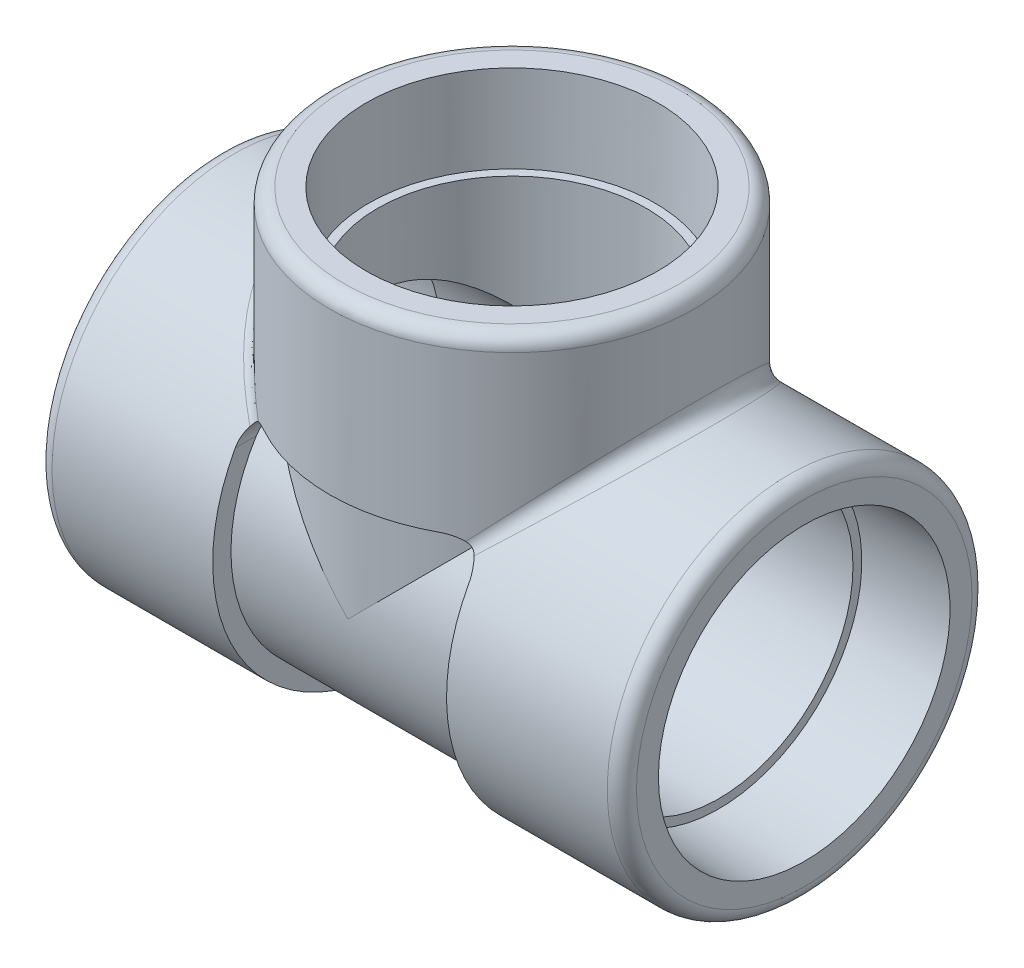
ISO-10303-21;
HEADER;
FILE_DESCRIPTION(('STEP AP214'),'2;1');
FILE_NAME('part.step','',(''),(''),'','','');
FILE_SCHEMA(('AUTOMOTIVE_DESIGN { 1 0 10303 214 1 1 1 1 }'));
ENDSEC;
DATA;
#1=APPLICATION_CONTEXT('core data for automotive mechanical design processes');
#2=APPLICATION_PROTOCOL_DEFINITION('international standard','automotive_design',2000,#1);
#3=PRODUCT_CONTEXT('',#1,'mechanical');
#4=PRODUCT('Part','Part','',(#3));
#5=PRODUCT_RELATED_PRODUCT_CATEGORY('part','',(#4));
#6=PRODUCT_DEFINITION_FORMATION('','',#4);
#7=PRODUCT_DEFINITION_CONTEXT('part definition',#1,'design');
#8=PRODUCT_DEFINITION('design','',#6,#7);
#9=PRODUCT_DEFINITION_SHAPE('','',#8);
#10=(LENGTH_UNIT() NAMED_UNIT(*) SI_UNIT(.MILLI.,.METRE.));
#11=(NAMED_UNIT(*) PLANE_ANGLE_UNIT() SI_UNIT($,.RADIAN.));
#12=(NAMED_UNIT(*) SI_UNIT($,.STERADIAN.) SOLID_ANGLE_UNIT());
#13=UNCERTAINTY_MEASURE_WITH_UNIT(LENGTH_MEASURE(1.E-05),#10,'distance_accuracy_value','');
#14=(GEOMETRIC_REPRESENTATION_CONTEXT(3) GLOBAL_UNCERTAINTY_ASSIGNED_CONTEXT((#13)) GLOBAL_UNIT_ASSIGNED_CONTEXT((#10,
#11,#12)) REPRESENTATION_CONTEXT('',''));
#15=CARTESIAN_POINT('',(0.,0.,0.));
#16=DIRECTION('',(0.,0.,1.));
#17=DIRECTION('',(1.,0.,0.));
#18=AXIS2_PLACEMENT_3D('',#15,#16,#17);
#19=CARTESIAN_POINT('',(-60.452,-4.2213405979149E-13,0.));
#20=DIRECTION('',(-1.,0.,0.));
#21=DIRECTION('',(0.,0.,-1.));
#22=AXIS2_PLACEMENT_3D('',#19,#20,#21);
#23=PLANE('',#22);
#24=CARTESIAN_POINT('',(-60.452,-4.2213405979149E-13,0.));
#25=DIRECTION('',(-1.,0.,0.));
#26=DIRECTION('',(0.,-1.,0.));
#27=AXIS2_PLACEMENT_3D('',#24,#25,#26);
#28=CIRCLE('',#27,34.6964);
#29=CARTESIAN_POINT('',(-60.4519999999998,-34.6964000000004,0.));
#30=VERTEX_POINT('',#29);
#31=EDGE_CURVE('E491',#30,#30,#28,.T.);
#32=ORIENTED_EDGE('',*,*,#31,.T.);
#33=EDGE_LOOP('',(#32));
#34=FACE_BOUND('',#33,.T.);
#35=CARTESIAN_POINT('',(-60.452,-4.2213405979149E-13,0.));
#36=DIRECTION('',(1.,0.,0.));
#37=DIRECTION('',(0.,0.,1.));
#38=AXIS2_PLACEMENT_3D('',#35,#36,#37);
#39=CIRCLE('',#38,30.1625);
#40=CARTESIAN_POINT('',(-60.452,-4.2213405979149E-13,30.1625));
#41=VERTEX_POINT('',#40);
#42=EDGE_CURVE('E170',#41,#41,#39,.T.);
#43=ORIENTED_EDGE('',*,*,#42,.T.);
#44=EDGE_LOOP('',(#43));
#45=FACE_BOUND('',#44,.T.);
#46=ADVANCED_FACE('F34',(#34,#45),#23,.T.);
#47=CARTESIAN_POINT('',(-2.11067029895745E-13,60.452,0.));
#48=DIRECTION('',(0.,1.,0.));
#49=DIRECTION('',(0.,0.,-1.));
#50=AXIS2_PLACEMENT_3D('',#47,#48,#49);
#51=PLANE('',#50);
#52=CARTESIAN_POINT('',(-2.11067029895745E-13,60.452,0.));
#53=DIRECTION('',(0.,1.,0.));
#54=DIRECTION('',(-1.,0.,0.));
#55=AXIS2_PLACEMENT_3D('',#52,#53,#54);
#56=CIRCLE('',#55,34.6964);
#57=CARTESIAN_POINT('',(-34.6964000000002,60.4519999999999,0.));
#58=VERTEX_POINT('',#57);
#59=EDGE_CURVE('E300',#58,#58,#56,.T.);
#60=ORIENTED_EDGE('',*,*,#59,.T.);
#61=EDGE_LOOP('',(#60));
#62=FACE_BOUND('',#61,.T.);
#63=CARTESIAN_POINT('',(-2.11067029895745E-13,60.452,0.));
#64=DIRECTION('',(0.,-1.,0.));
#65=DIRECTION('',(0.,0.,1.));
#66=AXIS2_PLACEMENT_3D('',#63,#64,#65);
#67=CIRCLE('',#66,30.1625);
#68=CARTESIAN_POINT('',(-2.11067029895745E-13,60.452,30.1625));
#69=VERTEX_POINT('',#68);
#70=EDGE_CURVE('E176',#69,#69,#67,.T.);
#71=ORIENTED_EDGE('',*,*,#70,.T.);
#72=EDGE_LOOP('',(#71));
#73=FACE_BOUND('',#72,.T.);
#74=ADVANCED_FACE('F247',(#62,#73),#51,.T.);
#75=CARTESIAN_POINT('',(60.452,0.,0.));
#76=DIRECTION('',(-1.,0.,0.));
#77=DIRECTION('',(0.,0.,1.));
#78=AXIS2_PLACEMENT_3D('',#75,#76,#77);
#79=CYLINDRICAL_SURFACE('',#78,33.9471);
#80=CARTESIAN_POINT('',(0.,0.,0.));
#81=DIRECTION('',(-0.707106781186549,0.707106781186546,0.));
#82=DIRECTION('',(-0.707106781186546,-0.707106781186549,0.));
#83=AXIS2_PLACEMENT_3D('',#80,#81,#82);
#84=ELLIPSE('',#83,48.0084492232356,33.9471);
#85=CARTESIAN_POINT('',(22.4102019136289,22.410201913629,-25.4987930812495));
#86=VERTEX_POINT('',#85);
#87=CARTESIAN_POINT('',(0.,0.,-33.9471));
#88=VERTEX_POINT('',#87);
#89=EDGE_CURVE('E196',#86,#88,#84,.T.);
#90=ORIENTED_EDGE('',*,*,#89,.F.);
#91=CARTESIAN_POINT('',(22.4102019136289,22.410201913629,-25.4987930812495));
#92=CARTESIAN_POINT('',(22.4886387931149,22.3317580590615,-25.5677366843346));
#93=CARTESIAN_POINT('',(22.5645112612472,22.2515745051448,-25.6375645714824));
#94=CARTESIAN_POINT('',(22.7111497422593,22.0879248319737,-25.7786895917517));
#95=CARTESIAN_POINT('',(22.7819164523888,22.0044591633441,-25.8499865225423));
#96=CARTESIAN_POINT('',(22.9865243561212,21.7495236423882,-26.0655572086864));
#97=CARTESIAN_POINT('',(23.1127861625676,21.5734017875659,-26.2116109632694));
#98=CARTESIAN_POINT('',(23.3417278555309,21.2153071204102,-26.5022280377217));
#99=CARTESIAN_POINT('',(23.4449609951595,21.0336286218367,-26.6467217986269));
#100=CARTESIAN_POINT('',(23.6319272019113,20.6611195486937,-26.9365812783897));
#101=CARTESIAN_POINT('',(23.715659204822,20.4702884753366,-27.0819470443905));
#102=CARTESIAN_POINT('',(23.8524302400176,20.1089242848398,-27.3510495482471));
#103=CARTESIAN_POINT('',(23.908159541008,19.9394615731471,-27.4748653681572));
#104=CARTESIAN_POINT('',(24.0045919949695,19.5954862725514,-27.7212422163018));
#105=CARTESIAN_POINT('',(24.0452993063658,19.4209750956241,-27.8438035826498));
#106=CARTESIAN_POINT('',(24.1120119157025,19.0634015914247,-28.0898639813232));
#107=CARTESIAN_POINT('',(24.1376385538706,18.8802345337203,-28.2133142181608));
#108=CARTESIAN_POINT('',(24.1720337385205,18.5103210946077,-28.4573902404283));
#109=CARTESIAN_POINT('',(24.1807924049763,18.3235726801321,-28.5780143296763));
#110=CARTESIAN_POINT('',(24.1808,18.1356000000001,-28.6967874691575));
#111=B_SPLINE_CURVE_WITH_KNOTS('',3,(#91,#92,#93,#94,#95,#96,#97,#98,#99,#100,#101,#102,#103,
#104,#105,#106,#107,#108,#109,#110),.UNSPECIFIED.,.F.,.F.,(4,2,2,2,2,2,2,2,2,4),(0.,
0.391739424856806,0.783425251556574,1.56623285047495,2.32750214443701,3.0888129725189,
3.73970363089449,4.39041397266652,5.0568336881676,5.72364362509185),.UNSPECIFIED.);
#112=CARTESIAN_POINT('',(24.1808,18.1356000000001,-28.6967874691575));
#113=VERTEX_POINT('',#112);
#114=EDGE_CURVE('E375',#86,#113,#111,.T.);
#115=ORIENTED_EDGE('',*,*,#114,.T.);
#116=CARTESIAN_POINT('',(24.1808,0.,0.));
#117=DIRECTION('',(1.,0.,0.));
#118=DIRECTION('',(0.,0.,-1.));
#119=AXIS2_PLACEMENT_3D('',#116,#117,#118);
#120=CIRCLE('',#119,33.9471);
#121=CARTESIAN_POINT('',(24.1808,18.1356000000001,28.6967874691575));
#122=VERTEX_POINT('',#121);
#123=EDGE_CURVE('E209',#122,#113,#120,.T.);
#124=ORIENTED_EDGE('',*,*,#123,.F.);
#125=CARTESIAN_POINT('',(24.1808,18.1356000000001,28.6967874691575));
#126=CARTESIAN_POINT('',(24.1807842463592,18.3563245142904,28.5573340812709));
#127=CARTESIAN_POINT('',(24.1687138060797,18.5753373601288,28.4153236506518));
#128=CARTESIAN_POINT('',(24.1214499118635,19.0082205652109,28.1275677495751));
#129=CARTESIAN_POINT('',(24.0862674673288,19.2220933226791,27.9818240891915));
#130=CARTESIAN_POINT('',(23.9950350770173,19.6374043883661,27.6918848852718));
#131=CARTESIAN_POINT('',(23.9395851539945,19.8390228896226,27.5477568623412));
#132=CARTESIAN_POINT('',(23.8084629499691,20.2347722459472,27.2583863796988));
#133=CARTESIAN_POINT('',(23.7327895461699,20.428902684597,27.1131438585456));
#134=CARTESIAN_POINT('',(23.5741275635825,20.7810847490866,26.8438807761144));
#135=CARTESIAN_POINT('',(23.4937708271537,20.9402998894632,26.7198225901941));
#136=CARTESIAN_POINT('',(23.3189037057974,21.2516337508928,26.4728754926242));
#137=CARTESIAN_POINT('',(23.2243974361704,21.4037545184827,26.3499862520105));
#138=CARTESIAN_POINT('',(23.0188783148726,21.703782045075,26.1034474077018));
#139=CARTESIAN_POINT('',(22.9075216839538,21.8514980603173,25.9798512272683));
#140=CARTESIAN_POINT('',(22.6699807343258,22.1378952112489,25.7362552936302));
#141=CARTESIAN_POINT('',(22.5437869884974,22.2765705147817,25.6162578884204));
#142=CARTESIAN_POINT('',(22.4102019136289,22.410201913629,25.4987930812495));
#143=B_SPLINE_CURVE_WITH_KNOTS('',3,(#125,#126,#127,#128,#129,#130,#131,#132,#133,#134,#135,
#136,#137,#138,#139,#140,#141,#142),.UNSPECIFIED.,.F.,.F.,(4,2,2,2,2,2,2,2,4),(0.,
0.782853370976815,1.56533409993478,2.32631171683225,3.0873315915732,3.73852184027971,
4.38952306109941,5.05626032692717,5.72342353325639),.UNSPECIFIED.);
#144=CARTESIAN_POINT('',(22.4102019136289,22.410201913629,25.4987930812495));
#145=VERTEX_POINT('',#144);
#146=EDGE_CURVE('E416',#122,#145,#143,.T.);
#147=ORIENTED_EDGE('',*,*,#146,.T.);
#148=CARTESIAN_POINT('',(0.,0.,33.9471));
#149=VERTEX_POINT('',#148);
#150=EDGE_CURVE('E199',#149,#145,#84,.T.);
#151=ORIENTED_EDGE('',*,*,#150,.F.);
#152=CARTESIAN_POINT('',(0.,0.,0.));
#153=DIRECTION('',(-0.707106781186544,-0.707106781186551,0.));
#154=DIRECTION('',(0.707106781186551,-0.707106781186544,0.));
#155=AXIS2_PLACEMENT_3D('',#152,#153,#154);
#156=ELLIPSE('',#155,48.0084492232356,33.9471);
#157=CARTESIAN_POINT('',(-22.4102019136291,22.4102019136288,25.4987930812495));
#158=VERTEX_POINT('',#157);
#159=EDGE_CURVE('E193',#149,#158,#156,.T.);
#160=ORIENTED_EDGE('',*,*,#159,.T.);
#161=CARTESIAN_POINT('',(-22.4102019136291,22.4102019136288,25.4987930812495));
#162=CARTESIAN_POINT('',(-22.488638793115,22.3317580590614,25.5677366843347));
#163=CARTESIAN_POINT('',(-22.5645112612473,22.2515745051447,25.6375645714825));
#164=CARTESIAN_POINT('',(-22.7111497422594,22.0879248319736,25.7786895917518));
#165=CARTESIAN_POINT('',(-22.7819164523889,22.004459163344,25.8499865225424));
#166=CARTESIAN_POINT('',(-22.9865243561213,21.7495236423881,26.0655572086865));
#167=CARTESIAN_POINT('',(-23.1127861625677,21.5734017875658,26.2116109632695));
#168=CARTESIAN_POINT('',(-23.341727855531,21.2153071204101,26.5022280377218));
#169=CARTESIAN_POINT('',(-23.4449609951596,21.0336286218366,26.646721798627));
#170=CARTESIAN_POINT('',(-23.6319272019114,20.6611195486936,26.9365812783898));
#171=CARTESIAN_POINT('',(-23.7156592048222,20.4702884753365,27.0819470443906));
#172=CARTESIAN_POINT('',(-23.8524302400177,20.1089242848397,27.3510495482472));
#173=CARTESIAN_POINT('',(-23.9081595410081,19.939461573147,27.4748653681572));
#174=CARTESIAN_POINT('',(-24.0045919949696,19.5954862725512,27.7212422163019));
#175=CARTESIAN_POINT('',(-24.0452993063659,19.420975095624,27.8438035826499));
#176=CARTESIAN_POINT('',(-24.1120119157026,19.0634015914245,28.0898639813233));
#177=CARTESIAN_POINT('',(-24.1376385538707,18.8802345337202,28.2133142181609));
#178=CARTESIAN_POINT('',(-24.1720337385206,18.5103210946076,28.4573902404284));
#179=CARTESIAN_POINT('',(-24.1807924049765,18.3235726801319,28.5780143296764));
#180=CARTESIAN_POINT('',(-24.1808000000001,18.1355999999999,28.6967874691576));
#181=B_SPLINE_CURVE_WITH_KNOTS('',3,(#161,#162,#163,#164,#165,#166,#167,#168,#169,#170,#171,
#172,#173,#174,#175,#176,#177,#178,#179,#180),.UNSPECIFIED.,.F.,.F.,(4,2,2,2,2,2,2,2,2,4),(0.,
0.391739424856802,0.783425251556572,1.56623285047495,2.32750214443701,3.0888129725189,
3.73970363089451,4.39041397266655,5.05683368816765,5.72364362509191),.UNSPECIFIED.);
#182=CARTESIAN_POINT('',(-24.1808000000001,18.1355999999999,28.6967874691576));
#183=VERTEX_POINT('',#182);
#184=EDGE_CURVE('E280',#158,#183,#181,.T.);
#185=ORIENTED_EDGE('',*,*,#184,.T.);
#186=CARTESIAN_POINT('',(-24.1808,0.,0.));
#187=DIRECTION('',(-1.,0.,0.));
#188=DIRECTION('',(0.,-1.,0.));
#189=AXIS2_PLACEMENT_3D('',#186,#187,#188);
#190=CIRCLE('',#189,33.9471);
#191=CARTESIAN_POINT('',(-24.1808000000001,18.1355999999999,-28.6967874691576));
#192=VERTEX_POINT('',#191);
#193=EDGE_CURVE('E189',#192,#183,#190,.T.);
#194=ORIENTED_EDGE('',*,*,#193,.F.);
#195=CARTESIAN_POINT('',(-24.1808000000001,18.1355999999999,-28.6967874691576));
#196=CARTESIAN_POINT('',(-24.1807842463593,18.3563245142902,-28.557334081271));
#197=CARTESIAN_POINT('',(-24.1687138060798,18.5753373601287,-28.4153236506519));
#198=CARTESIAN_POINT('',(-24.1214499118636,19.0082205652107,-28.1275677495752));
#199=CARTESIAN_POINT('',(-24.086267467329,19.2220933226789,-27.9818240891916));
#200=CARTESIAN_POINT('',(-23.9950350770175,19.637404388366,-27.6918848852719));
#201=CARTESIAN_POINT('',(-23.9395851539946,19.8390228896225,-27.5477568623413));
#202=CARTESIAN_POINT('',(-23.8084629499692,20.234772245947,-27.2583863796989));
#203=CARTESIAN_POINT('',(-23.73278954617,20.4289026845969,-27.1131438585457));
#204=CARTESIAN_POINT('',(-23.5741275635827,20.7810847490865,-26.8438807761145));
#205=CARTESIAN_POINT('',(-23.4937708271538,20.940299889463,-26.7198225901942));
#206=CARTESIAN_POINT('',(-23.3189037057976,21.2516337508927,-26.4728754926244));
#207=CARTESIAN_POINT('',(-23.2243974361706,21.4037545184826,-26.3499862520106));
#208=CARTESIAN_POINT('',(-23.0188783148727,21.7037820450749,-26.1034474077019));
#209=CARTESIAN_POINT('',(-22.907521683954,21.8514980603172,-25.9798512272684));
#210=CARTESIAN_POINT('',(-22.6699807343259,22.1378952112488,-25.7362552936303));
#211=CARTESIAN_POINT('',(-22.5437869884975,22.2765705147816,-25.6162578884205));
#212=CARTESIAN_POINT('',(-22.410201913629,22.4102019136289,-25.4987930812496));
#213=B_SPLINE_CURVE_WITH_KNOTS('',3,(#195,#196,#197,#198,#199,#200,#201,#202,#203,#204,#205,
#206,#207,#208,#209,#210,#211,#212),.UNSPECIFIED.,.F.,.F.,(4,2,2,2,2,2,2,2,4),(0.,
0.782853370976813,1.56533409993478,2.32631171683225,3.0873315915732,3.73852184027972,
4.38952306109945,5.05626032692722,5.72342353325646),.UNSPECIFIED.);
#214=CARTESIAN_POINT('',(-22.4102019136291,22.4102019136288,-25.4987930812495));
#215=VERTEX_POINT('',#214);
#216=EDGE_CURVE('E412',#192,#215,#213,.T.);
#217=ORIENTED_EDGE('',*,*,#216,.T.);
#218=EDGE_CURVE('E192',#215,#88,#156,.T.);
#219=ORIENTED_EDGE('',*,*,#218,.T.);
#220=EDGE_LOOP('',(#90,#115,#124,#147,#151,#160,#185,#194,#217,#219));
#221=FACE_BOUND('',#220,.T.);
#222=ADVANCED_FACE('F368',(#221),#79,.T.);
#223=CARTESIAN_POINT('',(24.1808,0.,0.));
#224=DIRECTION('',(1.,0.,0.));
#225=DIRECTION('',(0.,0.,-1.));
#226=AXIS2_PLACEMENT_3D('',#223,#224,#225);
#227=PLANE('',#226);
#228=ORIENTED_EDGE('',*,*,#123,.T.);
#229=DIRECTION('',(0.,0.,1.));
#230=VECTOR('',#229,1.);
#231=CARTESIAN_POINT('',(24.1808,18.1356000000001,-28.9484347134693));
#232=LINE('',#231,#230);
#233=CARTESIAN_POINT('',(24.1808,18.1356000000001,-33.0729946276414));
#234=VERTEX_POINT('',#233);
#235=EDGE_CURVE('E406',#113,#234,#232,.F.);
#236=ORIENTED_EDGE('',*,*,#235,.T.);
#237=CARTESIAN_POINT('',(24.1808,0.,0.));
#238=DIRECTION('',(1.,0.,0.));
#239=DIRECTION('',(0.,0.,-1.));
#240=AXIS2_PLACEMENT_3D('',#237,#238,#239);
#241=CIRCLE('',#240,37.719);
#242=CARTESIAN_POINT('',(24.1808,18.1356000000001,33.0729946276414));
#243=VERTEX_POINT('',#242);
#244=EDGE_CURVE('E206',#243,#234,#241,.T.);
#245=ORIENTED_EDGE('',*,*,#244,.F.);
#246=DIRECTION('',(0.,0.,1.));
#247=VECTOR('',#246,1.);
#248=CARTESIAN_POINT('',(24.1808,18.1356000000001,23.8263406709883));
#249=LINE('',#248,#247);
#250=EDGE_CURVE('E407',#243,#122,#249,.F.);
#251=ORIENTED_EDGE('',*,*,#250,.T.);
#252=EDGE_LOOP('',(#228,#236,#245,#251));
#253=FACE_BOUND('',#252,.T.);
#254=ADVANCED_FACE('F245',(#253),#227,.F.);
#255=CARTESIAN_POINT('',(-2.11067029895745E-13,60.452,0.));
#256=DIRECTION('',(0.,-1.,0.));
#257=DIRECTION('',(1.,0.,0.));
#258=AXIS2_PLACEMENT_3D('',#255,#256,#257);
#259=CYLINDRICAL_SURFACE('',#258,33.9471);
#260=ORIENTED_EDGE('',*,*,#150,.T.);
#261=CARTESIAN_POINT('',(22.4102019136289,22.410201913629,25.4987930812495));
#262=CARTESIAN_POINT('',(22.3317580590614,22.488638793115,25.5677366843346));
#263=CARTESIAN_POINT('',(22.2515745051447,22.5645112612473,25.6375645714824));
#264=CARTESIAN_POINT('',(22.0879248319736,22.7111497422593,25.7786895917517));
#265=CARTESIAN_POINT('',(22.004459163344,22.7819164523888,25.8499865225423));
#266=CARTESIAN_POINT('',(21.7495236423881,22.9865243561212,26.0655572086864));
#267=CARTESIAN_POINT('',(21.5734017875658,23.1127861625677,26.2116109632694));
#268=CARTESIAN_POINT('',(21.2153071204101,23.341727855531,26.5022280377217));
#269=CARTESIAN_POINT('',(21.0336286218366,23.4449609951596,26.6467217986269));
#270=CARTESIAN_POINT('',(20.6611195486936,23.6319272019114,26.9365812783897));
#271=CARTESIAN_POINT('',(20.4702884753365,23.7156592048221,27.0819470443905));
#272=CARTESIAN_POINT('',(20.1089242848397,23.8524302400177,27.3510495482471));
#273=CARTESIAN_POINT('',(19.9394615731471,23.908159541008,27.4748653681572));
#274=CARTESIAN_POINT('',(19.5954862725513,24.0045919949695,27.7212422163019));
#275=CARTESIAN_POINT('',(19.420975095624,24.0452993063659,27.8438035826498));
#276=CARTESIAN_POINT('',(19.0634015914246,24.1120119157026,28.0898639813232));
#277=CARTESIAN_POINT('',(18.8802345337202,24.1376385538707,28.2133142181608));
#278=CARTESIAN_POINT('',(18.5103210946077,24.1720337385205,28.4573902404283));
#279=CARTESIAN_POINT('',(18.323572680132,24.1807924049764,28.5780143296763));
#280=CARTESIAN_POINT('',(18.1356,24.1808000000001,28.6967874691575));
#281=B_SPLINE_CURVE_WITH_KNOTS('',3,(#261,#262,#263,#264,#265,#266,#267,#268,#269,#270,#271,
#272,#273,#274,#275,#276,#277,#278,#279,#280),.UNSPECIFIED.,.F.,.F.,(4,2,2,2,2,2,2,2,2,4),(0.,
0.39173942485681,0.783425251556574,1.56623285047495,2.32750214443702,3.0888129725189,
3.73970363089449,4.39041397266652,5.05683368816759,5.72364362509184),.UNSPECIFIED.);
#282=CARTESIAN_POINT('',(18.1356,24.1808000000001,28.6967874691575));
#283=VERTEX_POINT('',#282);
#284=EDGE_CURVE('E262',#145,#283,#281,.T.);
#285=ORIENTED_EDGE('',*,*,#284,.T.);
#286=CARTESIAN_POINT('',(0.,24.1808,0.));
#287=DIRECTION('',(0.,1.,0.));
#288=DIRECTION('',(-1.,0.,0.));
#289=AXIS2_PLACEMENT_3D('',#286,#287,#288);
#290=CIRCLE('',#289,33.9471);
#291=CARTESIAN_POINT('',(-18.1356000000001,24.1807999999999,28.6967874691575));
#292=VERTEX_POINT('',#291);
#293=EDGE_CURVE('E213',#292,#283,#290,.T.);
#294=ORIENTED_EDGE('',*,*,#293,.F.);
#295=CARTESIAN_POINT('',(-18.1356000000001,24.1807999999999,28.6967874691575));
#296=CARTESIAN_POINT('',(-18.3563245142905,24.1807842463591,28.5573340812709));
#297=CARTESIAN_POINT('',(-18.5753373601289,24.1687138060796,28.4153236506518));
#298=CARTESIAN_POINT('',(-19.008220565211,24.1214499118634,28.1275677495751));
#299=CARTESIAN_POINT('',(-19.2220933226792,24.0862674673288,27.9818240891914));
#300=CARTESIAN_POINT('',(-19.6374043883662,23.9950350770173,27.6918848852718));
#301=CARTESIAN_POINT('',(-19.8390228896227,23.9395851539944,27.5477568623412));
#302=CARTESIAN_POINT('',(-20.2347722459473,23.808462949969,27.2583863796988));
#303=CARTESIAN_POINT('',(-20.4289026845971,23.7327895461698,27.1131438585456));
#304=CARTESIAN_POINT('',(-20.7810847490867,23.5741275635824,26.8438807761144));
#305=CARTESIAN_POINT('',(-20.9402998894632,23.4937708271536,26.7198225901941));
#306=CARTESIAN_POINT('',(-21.2516337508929,23.3189037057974,26.4728754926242));
#307=CARTESIAN_POINT('',(-21.4037545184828,23.2243974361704,26.3499862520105));
#308=CARTESIAN_POINT('',(-21.7037820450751,23.0188783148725,26.1034474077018));
#309=CARTESIAN_POINT('',(-21.8514980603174,22.9075216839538,25.9798512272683));
#310=CARTESIAN_POINT('',(-22.1378952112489,22.6699807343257,25.7362552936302));
#311=CARTESIAN_POINT('',(-22.2765705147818,22.5437869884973,25.6162578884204));
#312=CARTESIAN_POINT('',(-22.4102019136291,22.4102019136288,25.4987930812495));
#313=B_SPLINE_CURVE_WITH_KNOTS('',3,(#295,#296,#297,#298,#299,#300,#301,#302,#303,#304,#305,
#306,#307,#308,#309,#310,#311,#312),.UNSPECIFIED.,.F.,.F.,(4,2,2,2,2,2,2,2,4),(0.,
0.782853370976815,1.56533409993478,2.32631171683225,3.0873315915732,3.73852184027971,
4.38952306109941,5.05626032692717,5.7234235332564),.UNSPECIFIED.);
#314=EDGE_CURVE('E256',#292,#158,#313,.T.);
#315=ORIENTED_EDGE('',*,*,#314,.T.);
#316=ORIENTED_EDGE('',*,*,#159,.F.);
#317=EDGE_LOOP('',(#260,#285,#294,#315,#316));
#318=FACE_BOUND('',#317,.T.);
#319=ADVANCED_FACE('F239',(#318),#259,.T.);
#320=CARTESIAN_POINT('',(18.1356,24.1808000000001,-28.6967874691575));
#321=VERTEX_POINT('',#320);
#322=CARTESIAN_POINT('',(-18.1356000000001,24.1807999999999,-28.6967874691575));
#323=VERTEX_POINT('',#322);
#324=EDGE_CURVE('E212',#321,#323,#290,.T.);
#325=ORIENTED_EDGE('',*,*,#324,.F.);
#326=CARTESIAN_POINT('',(18.1356,24.1808000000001,-28.6967874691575));
#327=CARTESIAN_POINT('',(18.3563245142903,24.1807842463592,-28.5573340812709));
#328=CARTESIAN_POINT('',(18.5753373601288,24.1687138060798,-28.4153236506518));
#329=CARTESIAN_POINT('',(19.0082205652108,24.1214499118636,-28.1275677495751));
#330=CARTESIAN_POINT('',(19.222093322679,24.0862674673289,-27.9818240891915));
#331=CARTESIAN_POINT('',(19.6374043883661,23.9950350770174,-27.6918848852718));
#332=CARTESIAN_POINT('',(19.8390228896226,23.9395851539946,-27.5477568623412));
#333=CARTESIAN_POINT('',(20.2347722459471,23.8084629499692,-27.2583863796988));
#334=CARTESIAN_POINT('',(20.428902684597,23.73278954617,-27.1131438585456));
#335=CARTESIAN_POINT('',(20.7810847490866,23.5741275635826,-26.8438807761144));
#336=CARTESIAN_POINT('',(20.9402998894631,23.4937708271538,-26.7198225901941));
#337=CARTESIAN_POINT('',(21.2516337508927,23.3189037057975,-26.4728754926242));
#338=CARTESIAN_POINT('',(21.4037545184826,23.2243974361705,-26.3499862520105));
#339=CARTESIAN_POINT('',(21.7037820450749,23.0188783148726,-26.1034474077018));
#340=CARTESIAN_POINT('',(21.8514980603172,22.9075216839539,-25.9798512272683));
#341=CARTESIAN_POINT('',(22.1378952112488,22.6699807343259,-25.7362552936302));
#342=CARTESIAN_POINT('',(22.2765705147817,22.5437869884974,-25.6162578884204));
#343=CARTESIAN_POINT('',(22.4102019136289,22.410201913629,-25.4987930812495));
#344=B_SPLINE_CURVE_WITH_KNOTS('',3,(#326,#327,#328,#329,#330,#331,#332,#333,#334,#335,#336,
#337,#338,#339,#340,#341,#342,#343),.UNSPECIFIED.,.F.,.F.,(4,2,2,2,2,2,2,2,4),(0.,
0.782853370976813,1.56533409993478,2.32631171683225,3.08733159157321,3.73852184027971,
4.38952306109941,5.05626032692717,5.72342353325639),.UNSPECIFIED.);
#345=EDGE_CURVE('E230',#321,#86,#344,.T.);
#346=ORIENTED_EDGE('',*,*,#345,.T.);
#347=ORIENTED_EDGE('',*,*,#89,.T.);
#348=ORIENTED_EDGE('',*,*,#218,.F.);
#349=CARTESIAN_POINT('',(-22.4102019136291,22.4102019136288,-25.4987930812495));
#350=CARTESIAN_POINT('',(-22.3317580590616,22.4886387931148,-25.5677366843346));
#351=CARTESIAN_POINT('',(-22.2515745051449,22.5645112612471,-25.6375645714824));
#352=CARTESIAN_POINT('',(-22.0879248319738,22.7111497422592,-25.7786895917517));
#353=CARTESIAN_POINT('',(-22.0044591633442,22.7819164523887,-25.8499865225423));
#354=CARTESIAN_POINT('',(-21.7495236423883,22.9865243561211,-26.0655572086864));
#355=CARTESIAN_POINT('',(-21.5734017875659,23.1127861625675,-26.2116109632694));
#356=CARTESIAN_POINT('',(-21.2153071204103,23.3417278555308,-26.5022280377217));
#357=CARTESIAN_POINT('',(-21.0336286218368,23.4449609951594,-26.6467217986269));
#358=CARTESIAN_POINT('',(-20.6611195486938,23.6319272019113,-26.9365812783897));
#359=CARTESIAN_POINT('',(-20.4702884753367,23.715659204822,-27.0819470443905));
#360=CARTESIAN_POINT('',(-20.1089242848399,23.8524302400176,-27.3510495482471));
#361=CARTESIAN_POINT('',(-19.9394615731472,23.9081595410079,-27.4748653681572));
#362=CARTESIAN_POINT('',(-19.5954862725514,24.0045919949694,-27.7212422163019));
#363=CARTESIAN_POINT('',(-19.4209750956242,24.0452993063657,-27.8438035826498));
#364=CARTESIAN_POINT('',(-19.0634015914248,24.1120119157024,-28.0898639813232));
#365=CARTESIAN_POINT('',(-18.8802345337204,24.1376385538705,-28.2133142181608));
#366=CARTESIAN_POINT('',(-18.5103210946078,24.1720337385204,-28.4573902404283));
#367=CARTESIAN_POINT('',(-18.3235726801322,24.1807924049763,-28.5780143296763));
#368=CARTESIAN_POINT('',(-18.1356000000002,24.1807999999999,-28.6967874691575));
#369=B_SPLINE_CURVE_WITH_KNOTS('',3,(#349,#350,#351,#352,#353,#354,#355,#356,#357,#358,#359,
#360,#361,#362,#363,#364,#365,#366,#367,#368),.UNSPECIFIED.,.F.,.F.,(4,2,2,2,2,2,2,2,2,4),(0.,
0.391739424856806,0.783425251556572,1.56623285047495,2.32750214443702,3.08881297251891,
3.7397036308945,4.39041397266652,5.0568336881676,5.72364362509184),.UNSPECIFIED.);
#370=EDGE_CURVE('E223',#215,#323,#369,.T.);
#371=ORIENTED_EDGE('',*,*,#370,.T.);
#372=EDGE_LOOP('',(#325,#346,#347,#348,#371));
#373=FACE_BOUND('',#372,.T.);
#374=ADVANCED_FACE('F244',(#373),#259,.T.);
#375=CARTESIAN_POINT('',(24.1808,0.,0.));
#376=DIRECTION('',(1.,0.,0.));
#377=DIRECTION('',(0.,0.,-1.));
#378=AXIS2_PLACEMENT_3D('',#375,#376,#377);
#379=CYLINDRICAL_SURFACE('',#378,37.719);
#380=CARTESIAN_POINT('',(57.4294,0.,0.));
#381=DIRECTION('',(1.,0.,0.));
#382=DIRECTION('',(0.,0.,-1.));
#383=AXIS2_PLACEMENT_3D('',#380,#381,#382);
#384=CIRCLE('',#383,37.719);
#385=CARTESIAN_POINT('',(57.4294,0.,-37.719));
#386=VERTEX_POINT('',#385);
#387=EDGE_CURVE('E363',#386,#386,#384,.F.);
#388=ORIENTED_EDGE('',*,*,#387,.T.);
#389=EDGE_LOOP('',(#388));
#390=FACE_BOUND('',#389,.T.);
#391=CARTESIAN_POINT('',(24.1808,18.1356000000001,-33.0729946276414));
#392=CARTESIAN_POINT('',(24.1807954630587,18.3658360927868,-32.946785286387));
#393=CARTESIAN_POINT('',(24.1676498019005,18.5946576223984,-32.8181450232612));
#394=CARTESIAN_POINT('',(24.1159850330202,19.0473748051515,-32.5574562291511));
#395=CARTESIAN_POINT('',(24.077472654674,19.2712717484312,-32.4254086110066));
#396=CARTESIAN_POINT('',(23.9775786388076,19.7052324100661,-32.1634760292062));
#397=CARTESIAN_POINT('',(23.9169545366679,19.9155097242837,-32.0336537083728));
#398=CARTESIAN_POINT('',(23.7734655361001,20.3279925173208,-31.7734961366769));
#399=CARTESIAN_POINT('',(23.6906033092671,20.5301989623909,-31.6431609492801));
#400=CARTESIAN_POINT('',(23.5247472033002,20.8796633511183,-31.4133062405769));
#401=CARTESIAN_POINT('',(23.4461444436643,21.0288851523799,-31.3135766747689));
#402=CARTESIAN_POINT('',(23.276323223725,21.3208653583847,-31.1155068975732));
#403=CARTESIAN_POINT('',(23.1851089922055,21.4636259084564,-31.0171662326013));
#404=CARTESIAN_POINT('',(22.9877848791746,21.7454591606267,-30.8202563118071));
#405=CARTESIAN_POINT('',(22.8813598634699,21.884350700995,-30.7217426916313));
#406=CARTESIAN_POINT('',(22.6554965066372,22.1537910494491,-30.528023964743));
#407=CARTESIAN_POINT('',(22.5360495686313,22.2843342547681,-30.4328210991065));
#408=CARTESIAN_POINT('',(22.4102019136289,22.410201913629,-30.339838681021));
#409=B_SPLINE_CURVE_WITH_KNOTS('',3,(#391,#392,#393,#394,#395,#396,#397,#398,#399,#400,#401,
#402,#403,#404,#405,#406,#407,#408),.UNSPECIFIED.,.F.,.F.,(4,2,2,2,2,2,2,2,4),(0.,
0.78723832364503,1.57426788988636,2.33653901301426,3.0987186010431,3.6860472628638,
4.27317946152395,4.87497586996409,5.47717200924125),.UNSPECIFIED.);
#410=CARTESIAN_POINT('',(23.1827648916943,21.462846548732,-31.0172400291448));
#411=VERTEX_POINT('',#410);
#412=EDGE_CURVE('E381',#234,#411,#409,.T.);
#413=ORIENTED_EDGE('',*,*,#412,.T.);
#414=CARTESIAN_POINT('',(0.,0.,0.));
#415=DIRECTION('',(0.679362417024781,-0.733802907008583,0.));
#416=DIRECTION('',(0.733802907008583,0.679362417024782,0.));
#417=AXIS2_PLACEMENT_3D('',#414,#415,#416);
#418=ELLIPSE('',#417,55.5211755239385,37.719);
#419=CARTESIAN_POINT('',(23.1827648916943,21.462846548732,31.0172400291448));
#420=VERTEX_POINT('',#419);
#421=EDGE_CURVE('E63',#411,#420,#418,.T.);
#422=ORIENTED_EDGE('',*,*,#421,.T.);
#423=CARTESIAN_POINT('',(22.4102019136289,22.410201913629,30.339838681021));
#424=CARTESIAN_POINT('',(22.574955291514,22.2453871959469,30.4616104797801));
#425=CARTESIAN_POINT('',(22.7287442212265,22.0726042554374,30.5871279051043));
#426=CARTESIAN_POINT('',(23.0139644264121,21.713134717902,30.8433279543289));
#427=CARTESIAN_POINT('',(23.1454063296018,21.5264547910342,30.974008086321));
#428=CARTESIAN_POINT('',(23.3818889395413,21.1471147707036,31.2341774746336));
#429=CARTESIAN_POINT('',(23.4876291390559,20.9548266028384,31.3635752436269));
#430=CARTESIAN_POINT('',(23.6774130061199,20.5606059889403,31.6234131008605));
#431=CARTESIAN_POINT('',(23.7614583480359,20.3586742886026,31.7538531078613));
#432=CARTESIAN_POINT('',(23.9464439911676,19.8359487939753,32.0842294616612));
#433=CARTESIAN_POINT('',(24.0322966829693,19.5094556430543,32.2839434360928));
#434=CARTESIAN_POINT('',(24.1203276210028,19.0059682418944,32.5812163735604));
#435=CARTESIAN_POINT('',(24.1428937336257,18.8336535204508,32.681130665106));
#436=CARTESIAN_POINT('',(24.1731270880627,18.4863855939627,32.8788153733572));
#437=CARTESIAN_POINT('',(24.1807862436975,18.3114310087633,32.9765845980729));
#438=CARTESIAN_POINT('',(24.1808,18.1356000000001,33.0729946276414));
#439=B_SPLINE_CURVE_WITH_KNOTS('',3,(#423,#424,#425,#426,#427,#428,#429,#430,#431,#432,#433,
#434,#435,#436,#437,#438),.UNSPECIFIED.,.F.,.F.,(4,2,2,2,2,2,2,4),(0.,0.788232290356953,
1.57608866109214,2.3392023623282,3.10225715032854,4.27428237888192,4.87517375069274,
5.47639098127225),.UNSPECIFIED.);
#440=EDGE_CURVE('E431',#420,#243,#439,.T.);
#441=ORIENTED_EDGE('',*,*,#440,.T.);
#442=ORIENTED_EDGE('',*,*,#244,.T.);
#443=EDGE_LOOP('',(#413,#422,#441,#442));
#444=FACE_BOUND('',#443,.T.);
#445=ADVANCED_FACE('F342',(#390,#444),#379,.T.);
#446=CARTESIAN_POINT('',(60.452,0.,0.));
#447=DIRECTION('',(1.,0.,0.));
#448=DIRECTION('',(0.,0.,-1.));
#449=AXIS2_PLACEMENT_3D('',#446,#447,#448);
#450=PLANE('',#449);
#451=CARTESIAN_POINT('',(60.452,0.,0.));
#452=DIRECTION('',(1.,0.,0.));
#453=DIRECTION('',(0.,0.,-1.));
#454=AXIS2_PLACEMENT_3D('',#451,#452,#453);
#455=CIRCLE('',#454,34.6964);
#456=CARTESIAN_POINT('',(60.452,0.,-34.6964));
#457=VERTEX_POINT('',#456);
#458=EDGE_CURVE('E507',#457,#457,#455,.T.);
#459=ORIENTED_EDGE('',*,*,#458,.T.);
#460=EDGE_LOOP('',(#459));
#461=FACE_BOUND('',#460,.T.);
#462=CARTESIAN_POINT('',(60.452,0.,0.));
#463=DIRECTION('',(-1.,0.,0.));
#464=DIRECTION('',(0.,0.,1.));
#465=AXIS2_PLACEMENT_3D('',#462,#463,#464);
#466=CIRCLE('',#465,30.1625);
#467=CARTESIAN_POINT('',(60.452,0.,30.1625));
#468=VERTEX_POINT('',#467);
#469=EDGE_CURVE('E200',#468,#468,#466,.T.);
#470=ORIENTED_EDGE('',*,*,#469,.T.);
#471=EDGE_LOOP('',(#470));
#472=FACE_BOUND('',#471,.T.);
#473=ADVANCED_FACE('F518',(#461,#472),#450,.T.);
#474=CARTESIAN_POINT('',(42.75074,29.6113696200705,0.));
#475=DIRECTION('',(1.,0.,0.));
#476=DIRECTION('',(0.,0.,-1.));
#477=AXIS2_PLACEMENT_3D('',#474,#475,#476);
#478=PLANE('',#477);
#479=CARTESIAN_POINT('',(42.75074,0.,0.));
#480=DIRECTION('',(1.,0.,0.));
#481=DIRECTION('',(0.,0.,-1.));
#482=AXIS2_PLACEMENT_3D('',#479,#480,#481);
#483=CIRCLE('',#482,27.7876);
#484=CARTESIAN_POINT('',(42.75074,0.,-27.7876));
#485=VERTEX_POINT('',#484);
#486=EDGE_CURVE('E167',#485,#485,#483,.T.);
#487=ORIENTED_EDGE('',*,*,#486,.F.);
#488=EDGE_LOOP('',(#487));
#489=FACE_BOUND('',#488,.T.);
#490=CARTESIAN_POINT('',(42.75074,0.,0.));
#491=DIRECTION('',(-1.,0.,0.));
#492=DIRECTION('',(0.,0.,1.));
#493=AXIS2_PLACEMENT_3D('',#490,#491,#492);
#494=CIRCLE('',#493,29.6113696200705);
#495=CARTESIAN_POINT('',(42.75074,0.,29.6113696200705));
#496=VERTEX_POINT('',#495);
#497=EDGE_CURVE('E203',#496,#496,#494,.T.);
#498=ORIENTED_EDGE('',*,*,#497,.F.);
#499=EDGE_LOOP('',(#498));
#500=FACE_BOUND('',#499,.T.);
#501=ADVANCED_FACE('F521',(#489,#500),#478,.T.);
#502=CARTESIAN_POINT('',(60.452,0.,0.));
#503=DIRECTION('',(1.,0.,0.));
#504=DIRECTION('',(0.,0.,-1.));
#505=AXIS2_PLACEMENT_3D('',#502,#503,#504);
#506=CONICAL_SURFACE('',#505,30.1625,0.0311250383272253);
#507=ORIENTED_EDGE('',*,*,#497,.T.);
#508=EDGE_LOOP('',(#507));
#509=FACE_BOUND('',#508,.T.);
#510=ORIENTED_EDGE('',*,*,#469,.F.);
#511=EDGE_LOOP('',(#510));
#512=FACE_BOUND('',#511,.T.);
#513=ADVANCED_FACE('F249',(#509,#512),#506,.F.);
#514=CARTESIAN_POINT('',(0.,24.1808,0.));
#515=DIRECTION('',(0.,1.,0.));
#516=DIRECTION('',(0.,0.,-1.));
#517=AXIS2_PLACEMENT_3D('',#514,#515,#516);
#518=PLANE('',#517);
#519=ORIENTED_EDGE('',*,*,#293,.T.);
#520=DIRECTION('',(0.,0.,1.));
#521=VECTOR('',#520,1.);
#522=CARTESIAN_POINT('',(18.1356,24.1808000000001,28.9484347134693));
#523=LINE('',#522,#521);
#524=CARTESIAN_POINT('',(18.1356,24.1808000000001,33.0729946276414));
#525=VERTEX_POINT('',#524);
#526=EDGE_CURVE('E263',#283,#525,#523,.T.);
#527=ORIENTED_EDGE('',*,*,#526,.T.);
#528=CARTESIAN_POINT('',(0.,24.1808,0.));
#529=DIRECTION('',(0.,1.,0.));
#530=DIRECTION('',(0.,0.,-1.));
#531=AXIS2_PLACEMENT_3D('',#528,#529,#530);
#532=CIRCLE('',#531,37.719);
#533=CARTESIAN_POINT('',(-18.1356000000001,24.1807999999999,33.0729946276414));
#534=VERTEX_POINT('',#533);
#535=EDGE_CURVE('E186',#534,#525,#532,.T.);
#536=ORIENTED_EDGE('',*,*,#535,.F.);
#537=DIRECTION('',(0.,0.,1.));
#538=VECTOR('',#537,1.);
#539=CARTESIAN_POINT('',(-18.1356000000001,24.1807999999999,23.8263406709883));
#540=LINE('',#539,#538);
#541=EDGE_CURVE('E397',#534,#292,#540,.F.);
#542=ORIENTED_EDGE('',*,*,#541,.T.);
#543=EDGE_LOOP('',(#519,#527,#536,#542));
#544=FACE_BOUND('',#543,.T.);
#545=ADVANCED_FACE('F309',(#544),#518,.F.);
#546=CARTESIAN_POINT('',(18.1356,24.1808000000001,-33.0729946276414));
#547=VERTEX_POINT('',#546);
#548=CARTESIAN_POINT('',(-18.1356000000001,24.1807999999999,-33.0729946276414));
#549=VERTEX_POINT('',#548);
#550=EDGE_CURVE('E185',#547,#549,#532,.T.);
#551=ORIENTED_EDGE('',*,*,#550,.F.);
#552=DIRECTION('',(0.,0.,1.));
#553=VECTOR('',#552,1.);
#554=CARTESIAN_POINT('',(18.1356,24.1808000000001,-23.8263406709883));
#555=LINE('',#554,#553);
#556=EDGE_CURVE('E220',#547,#321,#555,.T.);
#557=ORIENTED_EDGE('',*,*,#556,.T.);
#558=ORIENTED_EDGE('',*,*,#324,.T.);
#559=DIRECTION('',(0.,0.,1.));
#560=VECTOR('',#559,1.);
#561=CARTESIAN_POINT('',(-18.1356000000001,24.1807999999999,-28.9484347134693));
#562=LINE('',#561,#560);
#563=EDGE_CURVE('E216',#323,#549,#562,.F.);
#564=ORIENTED_EDGE('',*,*,#563,.T.);
#565=EDGE_LOOP('',(#551,#557,#558,#564));
#566=FACE_BOUND('',#565,.T.);
#567=ADVANCED_FACE('F458',(#566),#518,.F.);
#568=CARTESIAN_POINT('',(-24.1808,-1.68853623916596E-13,0.));
#569=DIRECTION('',(-1.,0.,0.));
#570=DIRECTION('',(0.,0.,-1.));
#571=AXIS2_PLACEMENT_3D('',#568,#569,#570);
#572=PLANE('',#571);
#573=CARTESIAN_POINT('',(-24.1808,-1.68853623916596E-13,0.));
#574=DIRECTION('',(-1.,0.,0.));
#575=DIRECTION('',(0.,0.,-1.));
#576=AXIS2_PLACEMENT_3D('',#573,#574,#575);
#577=CIRCLE('',#576,37.719);
#578=CARTESIAN_POINT('',(-24.1808000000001,18.1355999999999,-33.0729946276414));
#579=VERTEX_POINT('',#578);
#580=CARTESIAN_POINT('',(-24.1808000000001,18.1355999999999,33.0729946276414));
#581=VERTEX_POINT('',#580);
#582=EDGE_CURVE('E182',#579,#581,#577,.T.);
#583=ORIENTED_EDGE('',*,*,#582,.F.);
#584=DIRECTION('',(0.,0.,1.));
#585=VECTOR('',#584,1.);
#586=CARTESIAN_POINT('',(-24.1808000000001,18.1355999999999,-23.8263406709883));
#587=LINE('',#586,#585);
#588=EDGE_CURVE('E399',#579,#192,#587,.T.);
#589=ORIENTED_EDGE('',*,*,#588,.T.);
#590=ORIENTED_EDGE('',*,*,#193,.T.);
#591=DIRECTION('',(0.,0.,1.));
#592=VECTOR('',#591,1.);
#593=CARTESIAN_POINT('',(-24.1808000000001,18.1355999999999,28.9484347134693));
#594=LINE('',#593,#592);
#595=EDGE_CURVE('E401',#183,#581,#594,.T.);
#596=ORIENTED_EDGE('',*,*,#595,.T.);
#597=EDGE_LOOP('',(#583,#589,#590,#596));
#598=FACE_BOUND('',#597,.T.);
#599=ADVANCED_FACE('F307',(#598),#572,.F.);
#600=CARTESIAN_POINT('',(0.,24.1808,0.));
#601=DIRECTION('',(0.,1.,0.));
#602=DIRECTION('',(-1.,0.,0.));
#603=AXIS2_PLACEMENT_3D('',#600,#601,#602);
#604=CYLINDRICAL_SURFACE('',#603,37.719);
#605=CARTESIAN_POINT('',(-2.00513678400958E-13,57.4294,0.));
#606=DIRECTION('',(0.,1.,0.));
#607=DIRECTION('',(-1.,0.,0.));
#608=AXIS2_PLACEMENT_3D('',#605,#606,#607);
#609=CIRCLE('',#608,37.719);
#610=CARTESIAN_POINT('',(-37.7190000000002,57.4293999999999,0.));
#611=VERTEX_POINT('',#610);
#612=EDGE_CURVE('E496',#611,#611,#609,.F.);
#613=ORIENTED_EDGE('',*,*,#612,.T.);
#614=EDGE_LOOP('',(#613));
#615=FACE_BOUND('',#614,.T.);
#616=CARTESIAN_POINT('',(18.1356,24.1808000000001,33.0729946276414));
#617=CARTESIAN_POINT('',(18.3658360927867,24.1807954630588,32.946785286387));
#618=CARTESIAN_POINT('',(18.5946576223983,24.1676498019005,32.8181450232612));
#619=CARTESIAN_POINT('',(19.0473748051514,24.1159850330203,32.5574562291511));
#620=CARTESIAN_POINT('',(19.2712717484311,24.0774726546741,32.4254086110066));
#621=CARTESIAN_POINT('',(19.705232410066,23.9775786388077,32.1634760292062));
#622=CARTESIAN_POINT('',(19.9155097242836,23.916954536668,32.0336537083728));
#623=CARTESIAN_POINT('',(20.3279925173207,23.7734655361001,31.7734961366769));
#624=CARTESIAN_POINT('',(20.5301989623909,23.6906033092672,31.6431609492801));
#625=CARTESIAN_POINT('',(20.8796633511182,23.5247472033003,31.4133062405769));
#626=CARTESIAN_POINT('',(21.0288851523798,23.4461444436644,31.3135766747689));
#627=CARTESIAN_POINT('',(21.3208653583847,23.2763232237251,31.1155068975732));
#628=CARTESIAN_POINT('',(21.4636259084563,23.1851089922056,31.0171662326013));
#629=CARTESIAN_POINT('',(21.7454591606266,22.9877848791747,30.8202563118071));
#630=CARTESIAN_POINT('',(21.884350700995,22.88135986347,30.7217426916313));
#631=CARTESIAN_POINT('',(22.153791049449,22.6554965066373,30.528023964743));
#632=CARTESIAN_POINT('',(22.2843342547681,22.5360495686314,30.4328210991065));
#633=CARTESIAN_POINT('',(22.4102019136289,22.410201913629,30.339838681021));
#634=B_SPLINE_CURVE_WITH_KNOTS('',3,(#616,#617,#618,#619,#620,#621,#622,#623,#624,#625,#626,
#627,#628,#629,#630,#631,#632,#633),.UNSPECIFIED.,.F.,.F.,(4,2,2,2,2,2,2,2,4),(0.,
0.78723832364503,1.57426788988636,2.33653901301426,3.0987186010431,3.6860472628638,
4.27317946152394,4.87497586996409,5.47717200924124),.UNSPECIFIED.);
#635=CARTESIAN_POINT('',(21.4628465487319,23.1827648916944,31.0172400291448));
#636=VERTEX_POINT('',#635);
#637=EDGE_CURVE('E327',#525,#636,#634,.T.);
#638=ORIENTED_EDGE('',*,*,#637,.T.);
#639=CARTESIAN_POINT('',(0.,0.,0.));
#640=DIRECTION('',(0.733802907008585,-0.679362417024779,0.));
#641=DIRECTION('',(0.679362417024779,0.733802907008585,0.));
#642=AXIS2_PLACEMENT_3D('',#639,#640,#641);
#643=ELLIPSE('',#642,55.5211755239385,37.719);
#644=CARTESIAN_POINT('',(21.4628465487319,23.1827648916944,-31.0172400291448));
#645=VERTEX_POINT('',#644);
#646=EDGE_CURVE('E501',#636,#645,#643,.F.);
#647=ORIENTED_EDGE('',*,*,#646,.T.);
#648=CARTESIAN_POINT('',(22.4102019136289,22.410201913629,-30.339838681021));
#649=CARTESIAN_POINT('',(22.2453871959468,22.5749552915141,-30.4616104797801));
#650=CARTESIAN_POINT('',(22.0726042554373,22.7287442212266,-30.5871279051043));
#651=CARTESIAN_POINT('',(21.7131347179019,23.0139644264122,-30.8433279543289));
#652=CARTESIAN_POINT('',(21.5264547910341,23.1454063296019,-30.974008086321));
#653=CARTESIAN_POINT('',(21.1471147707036,23.3818889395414,-31.2341774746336));
#654=CARTESIAN_POINT('',(20.9548266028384,23.4876291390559,-31.3635752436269));
#655=CARTESIAN_POINT('',(20.5606059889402,23.67741300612,-31.6234131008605));
#656=CARTESIAN_POINT('',(20.3586742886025,23.761458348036,-31.7538531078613));
#657=CARTESIAN_POINT('',(19.8359487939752,23.9464439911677,-32.0842294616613));
#658=CARTESIAN_POINT('',(19.5094556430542,24.0322966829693,-32.2839434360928));
#659=CARTESIAN_POINT('',(19.0059682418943,24.1203276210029,-32.5812163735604));
#660=CARTESIAN_POINT('',(18.8336535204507,24.1428937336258,-32.681130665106));
#661=CARTESIAN_POINT('',(18.4863855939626,24.1731270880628,-32.8788153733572));
#662=CARTESIAN_POINT('',(18.3114310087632,24.1807862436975,-32.9765845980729));
#663=CARTESIAN_POINT('',(18.1356,24.1808000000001,-33.0729946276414));
#664=B_SPLINE_CURVE_WITH_KNOTS('',3,(#648,#649,#650,#651,#652,#653,#654,#655,#656,#657,#658,
#659,#660,#661,#662,#663),.UNSPECIFIED.,.F.,.F.,(4,2,2,2,2,2,2,4),(0.,0.788232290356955,
1.57608866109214,2.3392023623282,3.10225715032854,4.27428237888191,4.87517375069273,
5.47639098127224),.UNSPECIFIED.);
#665=EDGE_CURVE('E313',#645,#547,#664,.T.);
#666=ORIENTED_EDGE('',*,*,#665,.T.);
#667=ORIENTED_EDGE('',*,*,#550,.T.);
#668=CARTESIAN_POINT('',(-18.1356000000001,24.1807999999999,-33.0729946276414));
#669=CARTESIAN_POINT('',(-18.3658360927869,24.1807954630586,-32.946785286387));
#670=CARTESIAN_POINT('',(-18.5946576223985,24.1676498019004,-32.8181450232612));
#671=CARTESIAN_POINT('',(-19.0473748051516,24.1159850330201,-32.5574562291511));
#672=CARTESIAN_POINT('',(-19.2712717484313,24.0774726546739,-32.4254086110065));
#673=CARTESIAN_POINT('',(-19.7052324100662,23.9775786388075,-32.1634760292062));
#674=CARTESIAN_POINT('',(-19.9155097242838,23.9169545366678,-32.0336537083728));
#675=CARTESIAN_POINT('',(-20.3279925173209,23.7734655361,-31.7734961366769));
#676=CARTESIAN_POINT('',(-20.530198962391,23.6906033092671,-31.6431609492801));
#677=CARTESIAN_POINT('',(-20.8796633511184,23.5247472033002,-31.4133062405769));
#678=CARTESIAN_POINT('',(-21.02888515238,23.4461444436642,-31.3135766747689));
#679=CARTESIAN_POINT('',(-21.3208653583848,23.2763232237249,-31.1155068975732));
#680=CARTESIAN_POINT('',(-21.4636259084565,23.1851089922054,-31.0171662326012));
#681=CARTESIAN_POINT('',(-21.7454591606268,22.9877848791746,-30.8202563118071));
#682=CARTESIAN_POINT('',(-21.8843507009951,22.8813598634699,-30.7217426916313));
#683=CARTESIAN_POINT('',(-22.1537910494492,22.6554965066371,-30.528023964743));
#684=CARTESIAN_POINT('',(-22.2843342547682,22.5360495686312,-30.4328210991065));
#685=CARTESIAN_POINT('',(-22.4102019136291,22.4102019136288,-30.339838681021));
#686=B_SPLINE_CURVE_WITH_KNOTS('',3,(#668,#669,#670,#671,#672,#673,#674,#675,#676,#677,#678,
#679,#680,#681,#682,#683,#684,#685),.UNSPECIFIED.,.F.,.F.,(4,2,2,2,2,2,2,2,4),(0.,
0.787238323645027,1.57426788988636,2.33653901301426,3.0987186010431,3.6860472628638,
4.27317946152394,4.87497586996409,5.47717200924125),.UNSPECIFIED.);
#687=CARTESIAN_POINT('',(-21.4628465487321,23.1827648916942,-31.0172400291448));
#688=VERTEX_POINT('',#687);
#689=EDGE_CURVE('E320',#549,#688,#686,.T.);
#690=ORIENTED_EDGE('',*,*,#689,.T.);
#691=CARTESIAN_POINT('',(0.,0.,0.));
#692=DIRECTION('',(0.73380290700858,0.679362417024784,0.));
#693=DIRECTION('',(-0.679362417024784,0.73380290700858,0.));
#694=AXIS2_PLACEMENT_3D('',#691,#692,#693);
#695=ELLIPSE('',#694,55.5211755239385,37.719);
#696=CARTESIAN_POINT('',(-21.4628465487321,23.1827648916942,31.0172400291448));
#697=VERTEX_POINT('',#696);
#698=EDGE_CURVE('E653',#688,#697,#695,.T.);
#699=ORIENTED_EDGE('',*,*,#698,.T.);
#700=CARTESIAN_POINT('',(-22.4102019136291,22.4102019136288,30.339838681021));
#701=CARTESIAN_POINT('',(-22.245387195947,22.5749552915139,30.4616104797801));
#702=CARTESIAN_POINT('',(-22.0726042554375,22.7287442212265,30.5871279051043));
#703=CARTESIAN_POINT('',(-21.713134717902,23.0139644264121,30.8433279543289));
#704=CARTESIAN_POINT('',(-21.5264547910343,23.1454063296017,30.974008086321));
#705=CARTESIAN_POINT('',(-21.1471147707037,23.3818889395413,31.2341774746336));
#706=CARTESIAN_POINT('',(-20.9548266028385,23.4876291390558,31.3635752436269));
#707=CARTESIAN_POINT('',(-20.5606059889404,23.6774130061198,31.6234131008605));
#708=CARTESIAN_POINT('',(-20.3586742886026,23.7614583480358,31.7538531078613));
#709=CARTESIAN_POINT('',(-19.8359487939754,23.9464439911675,32.0842294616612));
#710=CARTESIAN_POINT('',(-19.5094556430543,24.0322966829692,32.2839434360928));
#711=CARTESIAN_POINT('',(-19.0059682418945,24.1203276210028,32.5812163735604));
#712=CARTESIAN_POINT('',(-18.8336535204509,24.1428937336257,32.681130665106));
#713=CARTESIAN_POINT('',(-18.4863855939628,24.1731270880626,32.8788153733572));
#714=CARTESIAN_POINT('',(-18.3114310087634,24.1807862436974,32.9765845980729));
#715=CARTESIAN_POINT('',(-18.1356000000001,24.1807999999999,33.0729946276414));
#716=B_SPLINE_CURVE_WITH_KNOTS('',3,(#700,#701,#702,#703,#704,#705,#706,#707,#708,#709,#710,
#711,#712,#713,#714,#715),.UNSPECIFIED.,.F.,.F.,(4,2,2,2,2,2,2,4),(0.,0.788232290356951,
1.57608866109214,2.3392023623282,3.10225715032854,4.27428237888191,4.87517375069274,
5.47639098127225),.UNSPECIFIED.);
#717=EDGE_CURVE('E295',#697,#534,#716,.T.);
#718=ORIENTED_EDGE('',*,*,#717,.T.);
#719=ORIENTED_EDGE('',*,*,#535,.T.);
#720=EDGE_LOOP('',(#638,#647,#666,#667,#690,#699,#718,#719));
#721=FACE_BOUND('',#720,.T.);
#722=ADVANCED_FACE('F302',(#615,#721),#604,.T.);
#723=CARTESIAN_POINT('',(-24.1808,-1.68853623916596E-13,0.));
#724=DIRECTION('',(-1.,0.,0.));
#725=DIRECTION('',(0.,-1.,0.));
#726=AXIS2_PLACEMENT_3D('',#723,#724,#725);
#727=CYLINDRICAL_SURFACE('',#726,37.719);
#728=CARTESIAN_POINT('',(-57.4294,-4.01027356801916E-13,0.));
#729=DIRECTION('',(-1.,0.,0.));
#730=DIRECTION('',(0.,-1.,0.));
#731=AXIS2_PLACEMENT_3D('',#728,#729,#730);
#732=CIRCLE('',#731,37.719);
#733=CARTESIAN_POINT('',(-57.4293999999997,-37.7190000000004,0.));
#734=VERTEX_POINT('',#733);
#735=EDGE_CURVE('E498',#734,#734,#732,.F.);
#736=ORIENTED_EDGE('',*,*,#735,.T.);
#737=EDGE_LOOP('',(#736));
#738=FACE_BOUND('',#737,.T.);
#739=CARTESIAN_POINT('',(-24.1808000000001,18.1355999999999,33.0729946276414));
#740=CARTESIAN_POINT('',(-24.1807954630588,18.3658360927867,32.946785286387));
#741=CARTESIAN_POINT('',(-24.1676498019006,18.5946576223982,32.8181450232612));
#742=CARTESIAN_POINT('',(-24.1159850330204,19.0473748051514,32.5574562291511));
#743=CARTESIAN_POINT('',(-24.0774726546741,19.2712717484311,32.4254086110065));
#744=CARTESIAN_POINT('',(-23.9775786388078,19.7052324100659,32.1634760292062));
#745=CARTESIAN_POINT('',(-23.916954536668,19.9155097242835,32.0336537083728));
#746=CARTESIAN_POINT('',(-23.7734655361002,20.3279925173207,31.7734961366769));
#747=CARTESIAN_POINT('',(-23.6906033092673,20.5301989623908,31.6431609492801));
#748=CARTESIAN_POINT('',(-23.5247472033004,20.8796633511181,31.4133062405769));
#749=CARTESIAN_POINT('',(-23.4461444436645,21.0288851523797,31.3135766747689));
#750=CARTESIAN_POINT('',(-23.2763232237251,21.3208653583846,31.1155068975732));
#751=CARTESIAN_POINT('',(-23.1851089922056,21.4636259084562,31.0171662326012));
#752=CARTESIAN_POINT('',(-22.9877848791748,21.7454591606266,30.8202563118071));
#753=CARTESIAN_POINT('',(-22.8813598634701,21.8843507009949,30.7217426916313));
#754=CARTESIAN_POINT('',(-22.6554965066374,22.1537910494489,30.528023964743));
#755=CARTESIAN_POINT('',(-22.5360495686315,22.284334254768,30.4328210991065));
#756=CARTESIAN_POINT('',(-22.4102019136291,22.4102019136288,30.339838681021));
#757=B_SPLINE_CURVE_WITH_KNOTS('',3,(#739,#740,#741,#742,#743,#744,#745,#746,#747,#748,#749,
#750,#751,#752,#753,#754,#755,#756),.UNSPECIFIED.,.F.,.F.,(4,2,2,2,2,2,2,2,4),(0.,
0.787238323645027,1.57426788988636,2.33653901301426,3.0987186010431,3.6860472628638,
4.27317946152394,4.87497586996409,5.47717200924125),.UNSPECIFIED.);
#758=CARTESIAN_POINT('',(-23.1827648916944,21.4628465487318,31.0172400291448));
#759=VERTEX_POINT('',#758);
#760=EDGE_CURVE('E289',#581,#759,#757,.T.);
#761=ORIENTED_EDGE('',*,*,#760,.T.);
#762=CARTESIAN_POINT('',(0.,0.,0.));
#763=DIRECTION('',(0.679362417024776,0.733802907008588,0.));
#764=DIRECTION('',(-0.733802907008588,0.679362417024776,0.));
#765=AXIS2_PLACEMENT_3D('',#762,#763,#764);
#766=ELLIPSE('',#765,55.5211755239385,37.719);
#767=CARTESIAN_POINT('',(-23.1827648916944,21.4628465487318,-31.0172400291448));
#768=VERTEX_POINT('',#767);
#769=EDGE_CURVE('E495',#759,#768,#766,.F.);
#770=ORIENTED_EDGE('',*,*,#769,.T.);
#771=CARTESIAN_POINT('',(-22.4102019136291,22.4102019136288,-30.339838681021));
#772=CARTESIAN_POINT('',(-22.5749552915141,22.2453871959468,-30.4616104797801));
#773=CARTESIAN_POINT('',(-22.7287442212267,22.0726042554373,-30.5871279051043));
#774=CARTESIAN_POINT('',(-23.0139644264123,21.7131347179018,-30.8433279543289));
#775=CARTESIAN_POINT('',(-23.1454063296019,21.5264547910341,-30.974008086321));
#776=CARTESIAN_POINT('',(-23.3818889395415,21.1471147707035,-31.2341774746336));
#777=CARTESIAN_POINT('',(-23.487629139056,20.9548266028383,-31.3635752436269));
#778=CARTESIAN_POINT('',(-23.6774130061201,20.5606059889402,-31.6234131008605));
#779=CARTESIAN_POINT('',(-23.761458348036,20.3586742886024,-31.7538531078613));
#780=CARTESIAN_POINT('',(-23.9464439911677,19.8359487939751,-32.0842294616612));
#781=CARTESIAN_POINT('',(-24.0322966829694,19.5094556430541,-32.2839434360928));
#782=CARTESIAN_POINT('',(-24.120327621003,19.0059682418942,-32.5812163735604));
#783=CARTESIAN_POINT('',(-24.1428937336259,18.8336535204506,-32.681130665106));
#784=CARTESIAN_POINT('',(-24.1731270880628,18.4863855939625,-32.8788153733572));
#785=CARTESIAN_POINT('',(-24.1807862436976,18.3114310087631,-32.9765845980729));
#786=CARTESIAN_POINT('',(-24.1808000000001,18.1355999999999,-33.0729946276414));
#787=B_SPLINE_CURVE_WITH_KNOTS('',3,(#771,#772,#773,#774,#775,#776,#777,#778,#779,#780,#781,
#782,#783,#784,#785,#786),.UNSPECIFIED.,.F.,.F.,(4,2,2,2,2,2,2,4),(0.,0.788232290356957,
1.57608866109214,2.3392023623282,3.10225715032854,4.27428237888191,4.87517375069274,
5.47639098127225),.UNSPECIFIED.);
#788=EDGE_CURVE('E434',#768,#579,#787,.T.);
#789=ORIENTED_EDGE('',*,*,#788,.T.);
#790=ORIENTED_EDGE('',*,*,#582,.T.);
#791=EDGE_LOOP('',(#761,#770,#789,#790));
#792=FACE_BOUND('',#791,.T.);
#793=ADVANCED_FACE('F306',(#738,#792),#727,.T.);
#794=CARTESIAN_POINT('',(-29.6113696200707,42.7507399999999,0.));
#795=DIRECTION('',(0.,1.,0.));
#796=DIRECTION('',(0.,0.,-1.));
#797=AXIS2_PLACEMENT_3D('',#794,#795,#796);
#798=PLANE('',#797);
#799=CARTESIAN_POINT('',(-1.49832609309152E-13,42.75074,0.));
#800=DIRECTION('',(0.,1.,0.));
#801=DIRECTION('',(-1.,0.,0.));
#802=AXIS2_PLACEMENT_3D('',#799,#800,#801);
#803=CIRCLE('',#802,27.7876);
#804=CARTESIAN_POINT('',(-27.7876000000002,42.7507399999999,0.));
#805=VERTEX_POINT('',#804);
#806=EDGE_CURVE('E161',#805,#805,#803,.F.);
#807=ORIENTED_EDGE('',*,*,#806,.T.);
#808=EDGE_LOOP('',(#807));
#809=FACE_BOUND('',#808,.T.);
#810=CARTESIAN_POINT('',(-1.49263410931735E-13,42.75074,0.));
#811=DIRECTION('',(0.,-1.,0.));
#812=DIRECTION('',(0.,0.,1.));
#813=AXIS2_PLACEMENT_3D('',#810,#811,#812);
#814=CIRCLE('',#813,29.6113696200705);
#815=CARTESIAN_POINT('',(-1.49263410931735E-13,42.75074,29.6113696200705));
#816=VERTEX_POINT('',#815);
#817=EDGE_CURVE('E179',#816,#816,#814,.T.);
#818=ORIENTED_EDGE('',*,*,#817,.F.);
#819=EDGE_LOOP('',(#818));
#820=FACE_BOUND('',#819,.T.);
#821=ADVANCED_FACE('F452',(#809,#820),#798,.T.);
#822=CARTESIAN_POINT('',(-2.11067029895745E-13,60.452,0.));
#823=DIRECTION('',(0.,1.,0.));
#824=DIRECTION('',(0.,0.,-1.));
#825=AXIS2_PLACEMENT_3D('',#822,#823,#824);
#826=CONICAL_SURFACE('',#825,30.1625,0.0311250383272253);
#827=ORIENTED_EDGE('',*,*,#817,.T.);
#828=EDGE_LOOP('',(#827));
#829=FACE_BOUND('',#828,.T.);
#830=ORIENTED_EDGE('',*,*,#70,.F.);
#831=EDGE_LOOP('',(#830));
#832=FACE_BOUND('',#831,.T.);
#833=ADVANCED_FACE('F462',(#829,#832),#826,.F.);
#834=CARTESIAN_POINT('',(-42.7507399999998,-29.6113696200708,0.));
#835=DIRECTION('',(-1.,0.,0.));
#836=DIRECTION('',(0.,0.,-1.));
#837=AXIS2_PLACEMENT_3D('',#834,#835,#836);
#838=PLANE('',#837);
#839=CARTESIAN_POINT('',(-42.75074,0.,0.));
#840=DIRECTION('',(-1.,0.,0.));
#841=DIRECTION('',(0.,-1.,0.));
#842=AXIS2_PLACEMENT_3D('',#839,#840,#841);
#843=CIRCLE('',#842,27.7876);
#844=CARTESIAN_POINT('',(-42.7507399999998,-27.7876,0.));
#845=VERTEX_POINT('',#844);
#846=EDGE_CURVE('E164',#845,#845,#843,.T.);
#847=ORIENTED_EDGE('',*,*,#846,.F.);
#848=EDGE_LOOP('',(#847));
#849=FACE_BOUND('',#848,.T.);
#850=CARTESIAN_POINT('',(-42.75074,-2.98526821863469E-13,0.));
#851=DIRECTION('',(1.,0.,0.));
#852=DIRECTION('',(0.,0.,1.));
#853=AXIS2_PLACEMENT_3D('',#850,#851,#852);
#854=CIRCLE('',#853,29.6113696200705);
#855=CARTESIAN_POINT('',(-42.75074,-2.98526821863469E-13,29.6113696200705));
#856=VERTEX_POINT('',#855);
#857=EDGE_CURVE('E173',#856,#856,#854,.T.);
#858=ORIENTED_EDGE('',*,*,#857,.F.);
#859=EDGE_LOOP('',(#858));
#860=FACE_BOUND('',#859,.T.);
#861=ADVANCED_FACE('F466',(#849,#860),#838,.T.);
#862=CARTESIAN_POINT('',(-60.452,-4.2213405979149E-13,0.));
#863=DIRECTION('',(-1.,0.,0.));
#864=DIRECTION('',(0.,0.,-1.));
#865=AXIS2_PLACEMENT_3D('',#862,#863,#864);
#866=CONICAL_SURFACE('',#865,30.1625,0.0311250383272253);
#867=ORIENTED_EDGE('',*,*,#857,.T.);
#868=EDGE_LOOP('',(#867));
#869=FACE_BOUND('',#868,.T.);
#870=ORIENTED_EDGE('',*,*,#42,.F.);
#871=EDGE_LOOP('',(#870));
#872=FACE_BOUND('',#871,.T.);
#873=ADVANCED_FACE('F470',(#869,#872),#866,.F.);
#874=CARTESIAN_POINT('',(-60.452,0.,0.));
#875=DIRECTION('',(1.,0.,0.));
#876=DIRECTION('',(0.,0.,-1.));
#877=AXIS2_PLACEMENT_3D('',#874,#875,#876);
#878=CYLINDRICAL_SURFACE('',#877,27.7876);
#879=CARTESIAN_POINT('',(0.,0.,0.));
#880=DIRECTION('',(-0.707106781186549,0.707106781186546,0.));
#881=DIRECTION('',(0.707106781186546,0.707106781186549,0.));
#882=AXIS2_PLACEMENT_3D('',#879,#880,#881);
#883=ELLIPSE('',#882,39.2976007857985,27.7876);
#884=CARTESIAN_POINT('',(0.,0.,-27.7876));
#885=VERTEX_POINT('',#884);
#886=CARTESIAN_POINT('',(0.,0.,27.7876));
#887=VERTEX_POINT('',#886);
#888=EDGE_CURVE('E153',#885,#887,#883,.F.);
#889=ORIENTED_EDGE('',*,*,#888,.F.);
#890=CARTESIAN_POINT('',(0.,0.,0.));
#891=DIRECTION('',(0.707106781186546,0.707106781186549,0.));
#892=DIRECTION('',(-0.707106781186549,0.707106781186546,0.));
#893=AXIS2_PLACEMENT_3D('',#890,#891,#892);
#894=ELLIPSE('',#893,39.2976007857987,27.7876);
#895=EDGE_CURVE('E156',#887,#885,#894,.F.);
#896=ORIENTED_EDGE('',*,*,#895,.F.);
#897=EDGE_LOOP('',(#889,#896));
#898=FACE_BOUND('',#897,.T.);
#899=ORIENTED_EDGE('',*,*,#486,.T.);
#900=EDGE_LOOP('',(#899));
#901=FACE_BOUND('',#900,.T.);
#902=ORIENTED_EDGE('',*,*,#846,.T.);
#903=EDGE_LOOP('',(#902));
#904=FACE_BOUND('',#903,.T.);
#905=ADVANCED_FACE('F159',(#898,#901,#904),#878,.F.);
#906=CARTESIAN_POINT('',(1.31129640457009E-13,-37.7200000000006,0.));
#907=DIRECTION('',(0.,1.,0.));
#908=DIRECTION('',(-1.,0.,0.));
#909=AXIS2_PLACEMENT_3D('',#906,#907,#908);
#910=CYLINDRICAL_SURFACE('',#909,27.7876);
#911=ORIENTED_EDGE('',*,*,#806,.F.);
#912=EDGE_LOOP('',(#911));
#913=FACE_BOUND('',#912,.T.);
#914=ORIENTED_EDGE('',*,*,#895,.T.);
#915=ORIENTED_EDGE('',*,*,#888,.T.);
#916=EDGE_LOOP('',(#914,#915));
#917=FACE_BOUND('',#916,.T.);
#918=ADVANCED_FACE('F155',(#913,#917),#910,.F.);
#919=CARTESIAN_POINT('',(18.1356,18.1356000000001,0.));
#920=DIRECTION('',(0.,0.,-1.));
#921=DIRECTION('',(-1.,0.,0.));
#922=AXIS2_PLACEMENT_3D('',#919,#920,#921);
#923=CYLINDRICAL_SURFACE('',#922,6.0452);
#924=ORIENTED_EDGE('',*,*,#412,.F.);
#925=ORIENTED_EDGE('',*,*,#235,.F.);
#926=ORIENTED_EDGE('',*,*,#114,.F.);
#927=ORIENTED_EDGE('',*,*,#345,.F.);
#928=ORIENTED_EDGE('',*,*,#556,.F.);
#929=ORIENTED_EDGE('',*,*,#665,.F.);
#930=CARTESIAN_POINT('',(0.,0.,37.719));
#931=CARTESIAN_POINT('',(0.,0.,37.719));
#932=CARTESIAN_POINT('',(0.,0.,37.719));
#933=CARTESIAN_POINT('',(0.821694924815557,0.88754118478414,37.718956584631));
#934=CARTESIAN_POINT('',(0.854625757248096,0.8546257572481,37.7190940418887));
#935=CARTESIAN_POINT('',(0.887541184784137,0.821694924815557,37.718956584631));
#936=CARTESIAN_POINT('',(1.6433898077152,1.77508232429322,37.69214704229));
#937=CARTESIAN_POINT('',(1.70984566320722,1.70984566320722,37.6899886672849));
#938=CARTESIAN_POINT('',(1.77508232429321,1.64338980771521,37.69214704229));
#939=CARTESIAN_POINT('',(3.28508387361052,3.54833301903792,37.584688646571));
#940=CARTESIAN_POINT('',(3.41689269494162,3.41689269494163,37.5738632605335));
#941=CARTESIAN_POINT('',(3.54833301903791,3.28508387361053,37.584688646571));
#942=CARTESIAN_POINT('',(4.10508290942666,4.43404241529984,37.5040353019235));
#943=CARTESIAN_POINT('',(4.26993177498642,4.26993177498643,37.4866729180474));
#944=CARTESIAN_POINT('',(4.43404241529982,4.10508290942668,37.5040353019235));
#945=CARTESIAN_POINT('',(5.73457986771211,6.19411859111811,37.2895000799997));
#946=CARTESIAN_POINT('',(5.96300501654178,5.9630050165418,37.2551116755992));
#947=CARTESIAN_POINT('',(6.19411859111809,5.73457986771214,37.2895000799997));
#948=CARTESIAN_POINT('',(6.5441077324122,7.06851771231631,37.1560776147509));
#949=CARTESIAN_POINT('',(6.80428158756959,6.80428158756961,37.1109059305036));
#950=CARTESIAN_POINT('',(7.06851771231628,6.54410773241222,37.1560776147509));
#951=CARTESIAN_POINT('',(8.15770214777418,8.81141700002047,36.8354667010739));
#952=CARTESIAN_POINT('',(8.47874512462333,8.47874512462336,36.7651252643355));
#953=CARTESIAN_POINT('',(8.81141700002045,8.15770214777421,36.8354667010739));
#954=CARTESIAN_POINT('',(8.96176881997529,9.67991729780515,36.6482794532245));
#955=CARTESIAN_POINT('',(9.31307302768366,9.31307302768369,36.5630640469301));
#956=CARTESIAN_POINT('',(9.67991729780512,8.96176881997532,36.6482794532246));
#957=CARTESIAN_POINT('',(11.3363707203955,12.2448071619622,36.0120188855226));
#958=CARTESIAN_POINT('',(11.779442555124,11.779442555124,35.8756208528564));
#959=CARTESIAN_POINT('',(12.2448071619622,11.3363707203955,36.0120188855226));
#960=CARTESIAN_POINT('',(12.8970509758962,13.9305520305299,35.484631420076));
#961=CARTESIAN_POINT('',(13.396660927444,13.3966609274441,35.3048936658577));
#962=CARTESIAN_POINT('',(13.9305520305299,12.8970509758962,35.484631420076));
#963=CARTESIAN_POINT('',(15.1844551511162,16.4012566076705,34.5371375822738));
#964=CARTESIAN_POINT('',(15.742862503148,15.7428625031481,34.2923974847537));
#965=CARTESIAN_POINT('',(16.4012566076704,15.1844551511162,34.5371375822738));
#966=CARTESIAN_POINT('',(15.9289297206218,17.2053894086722,34.200418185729));
#967=CARTESIAN_POINT('',(16.5088018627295,16.5088018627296,33.9308564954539));
#968=CARTESIAN_POINT('',(17.2053894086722,15.9289297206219,34.200418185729));
#969=CARTESIAN_POINT('',(17.4046574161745,18.7993740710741,33.4735340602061));
#970=CARTESIAN_POINT('',(18.0231359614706,18.0231359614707,33.1526796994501));
#971=CARTESIAN_POINT('',(18.799374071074,17.4046574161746,33.4735340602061));
#972=CARTESIAN_POINT('',(18.1359110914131,19.589226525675,33.0833715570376));
#973=CARTESIAN_POINT('',(18.772308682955,18.7723086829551,32.7350265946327));
#974=CARTESIAN_POINT('',(19.589226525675,18.1359110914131,33.0833715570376));
#975=CARTESIAN_POINT('',(20.2601822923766,21.8837255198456,31.8569373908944));
#976=CARTESIAN_POINT('',(20.95289958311,20.95289958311,31.419463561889));
#977=CARTESIAN_POINT('',(21.8837255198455,20.2601822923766,31.8569373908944));
#978=CARTESIAN_POINT('',(21.6321439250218,23.3656288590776,30.9448543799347));
#979=CARTESIAN_POINT('',(22.3488599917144,22.3488599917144,30.4443009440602));
#980=CARTESIAN_POINT('',(23.3656288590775,21.6321439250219,30.9448543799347));
#981=CARTESIAN_POINT('',(23.6017489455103,25.4930675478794,29.4334888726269));
#982=CARTESIAN_POINT('',(24.3221678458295,24.3221678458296,28.8564523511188));
#983=CARTESIAN_POINT('',(25.4930675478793,23.6017489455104,29.4334888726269));
#984=CARTESIAN_POINT('',(24.2318459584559,26.1736571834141,28.9174103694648));
#985=CARTESIAN_POINT('',(24.9554097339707,24.9554097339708,28.3112787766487));
#986=CARTESIAN_POINT('',(26.173657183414,24.231845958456,28.9174103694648));
#987=CARTESIAN_POINT('',(25.469391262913,27.5103727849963,27.8336148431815));
#988=CARTESIAN_POINT('',(26.1937723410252,26.1937723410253,27.1712869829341));
#989=CARTESIAN_POINT('',(27.5103727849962,25.4693912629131,27.8336148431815));
#990=CARTESIAN_POINT('',(26.0768390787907,28.1664982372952,27.2658967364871));
#991=CARTESIAN_POINT('',(26.7990070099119,26.799007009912,26.5753048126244));
#992=CARTESIAN_POINT('',(28.1664982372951,26.0768390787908,27.2658967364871));
#993=CARTESIAN_POINT('',(27.8092386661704,30.0377231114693,25.5334550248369));
#994=CARTESIAN_POINT('',(28.527628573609,28.5276285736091,24.7533023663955));
#995=CARTESIAN_POINT('',(30.0377231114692,27.8092386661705,25.5334550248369));
#996=CARTESIAN_POINT('',(28.8997658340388,31.2156393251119,24.2973108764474));
#997=CARTESIAN_POINT('',(29.5961576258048,29.5961576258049,23.4664631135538));
#998=CARTESIAN_POINT('',(31.2156393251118,28.899765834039,24.2973108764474));
#999=CARTESIAN_POINT('',(30.4141201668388,32.8513459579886,22.3237866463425));
#1000=CARTESIAN_POINT('',(31.0504950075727,31.0504950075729,21.4569371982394));
#1001=CARTESIAN_POINT('',(32.8513459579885,30.4141201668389,22.3237866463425));
#1002=CARTESIAN_POINT('',(30.8887237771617,33.3639817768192,21.6630318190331));
#1003=CARTESIAN_POINT('',(31.5064525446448,31.506452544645,20.7815977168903));
#1004=CARTESIAN_POINT('',(33.3639817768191,30.8887237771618,21.6630318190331));
#1005=CARTESIAN_POINT('',(31.8039352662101,34.3525334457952,20.2955471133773));
#1006=CARTESIAN_POINT('',(32.3799033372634,32.3799033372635,19.3927670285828));
#1007=CARTESIAN_POINT('',(34.352533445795,31.8039352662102,20.2955471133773));
#1008=CARTESIAN_POINT('',(32.2445410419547,34.8284470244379,19.5888143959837));
#1009=CARTESIAN_POINT('',(32.796741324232,32.7967413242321,18.6787580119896));
#1010=CARTESIAN_POINT('',(34.8284470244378,32.2445410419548,19.5888143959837));
#1011=CARTESIAN_POINT('',(33.068214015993,35.7181247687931,18.1621753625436));
#1012=CARTESIAN_POINT('',(33.5700491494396,33.5700491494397,17.247947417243));
#1013=CARTESIAN_POINT('',(35.718124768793,33.0682140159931,18.1621753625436));
#1014=CARTESIAN_POINT('',(33.4529573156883,36.1336993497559,17.4442065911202));
#1015=CARTESIAN_POINT('',(33.9278454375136,33.9278454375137,16.5319956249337));
#1016=CARTESIAN_POINT('',(36.1336993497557,33.4529573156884,17.4442065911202));
#1017=CARTESIAN_POINT('',(34.1819374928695,36.9210961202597,15.9685581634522));
#1018=CARTESIAN_POINT('',(34.6007990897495,34.6007990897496,15.0709039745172));
#1019=CARTESIAN_POINT('',(36.9210961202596,34.1819374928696,15.9685581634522));
#1020=CARTESIAN_POINT('',(34.5261923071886,37.2929376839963,15.210896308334));
#1021=CARTESIAN_POINT('',(34.9150751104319,34.9150751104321,14.3259439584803));
#1022=CARTESIAN_POINT('',(37.2929376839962,34.5261923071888,15.210896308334));
#1023=CARTESIAN_POINT('',(35.1568863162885,37.9741721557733,13.6882641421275));
#1024=CARTESIAN_POINT('',(35.4864615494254,35.4864615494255,12.8401050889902));
#1025=CARTESIAN_POINT('',(37.9741721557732,35.1568863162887,13.6882641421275));
#1026=CARTESIAN_POINT('',(35.4450569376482,38.2854352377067,12.9247317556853));
#1027=CARTESIAN_POINT('',(35.7445559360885,35.7445559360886,12.1003727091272));
#1028=CARTESIAN_POINT('',(38.2854352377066,35.4450569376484,12.9247317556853));
#1029=CARTESIAN_POINT('',(35.9751527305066,38.8580100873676,11.3661203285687));
#1030=CARTESIAN_POINT('',(36.216150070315,36.2161500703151,10.6006244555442));
#1031=CARTESIAN_POINT('',(38.8580100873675,35.9751527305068,11.3661203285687));
#1032=CARTESIAN_POINT('',(36.2170804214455,39.1193245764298,10.5710430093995));
#1033=CARTESIAN_POINT('',(36.4287233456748,36.4287233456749,9.84158674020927));
#1034=CARTESIAN_POINT('',(39.1193245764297,36.2170804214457,10.5710430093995));
#1035=CARTESIAN_POINT('',(36.6439604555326,39.5804125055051,8.97790054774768));
#1036=CARTESIAN_POINT('',(36.801641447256,36.8016414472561,8.3302219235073));
#1037=CARTESIAN_POINT('',(39.5804125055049,36.6439604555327,8.97790054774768));
#1038=CARTESIAN_POINT('',(36.8303987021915,39.7817909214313,8.18063391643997));
#1039=CARTESIAN_POINT('',(36.9625911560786,36.9625911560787,7.57947518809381));
#1040=CARTESIAN_POINT('',(39.7817909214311,36.8303987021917,8.18063391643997));
#1041=CARTESIAN_POINT('',(37.1522819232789,40.1294681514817,6.56571517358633));
#1042=CARTESIAN_POINT('',(37.2394045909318,37.239404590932,6.06606392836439));
#1043=CARTESIAN_POINT('',(40.1294681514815,37.152281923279,6.56571517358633));
#1044=CARTESIAN_POINT('',(37.2877291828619,40.2757694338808,5.74806397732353));
#1045=CARTESIAN_POINT('',(37.3545761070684,37.3545761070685,5.30509691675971));
#1046=CARTESIAN_POINT('',(40.2757694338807,37.2877291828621,5.74806397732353));
#1047=CARTESIAN_POINT('',(37.5031174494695,40.5084177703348,4.11202167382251));
#1048=CARTESIAN_POINT('',(37.5374477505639,37.5374477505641,3.78717224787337));
#1049=CARTESIAN_POINT('',(40.5084177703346,37.5031174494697,4.11202167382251));
#1050=CARTESIAN_POINT('',(37.5839276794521,40.5957037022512,3.2938601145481));
#1051=CARTESIAN_POINT('',(37.6054116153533,37.6054116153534,3.03221923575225));
#1052=CARTESIAN_POINT('',(40.5957037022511,37.5839276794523,3.2938601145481));
#1053=CARTESIAN_POINT('',(37.6918684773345,40.7122943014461,1.65046561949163));
#1054=CARTESIAN_POINT('',(37.6963154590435,37.6963154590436,1.51713008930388));
#1055=CARTESIAN_POINT('',(40.712294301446,37.6918684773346,1.65046561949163));
#1056=CARTESIAN_POINT('',(37.7189999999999,40.7416,0.825232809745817));
#1057=CARTESIAN_POINT('',(37.7189999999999,37.719,0.759111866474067));
#1058=CARTESIAN_POINT('',(40.7415999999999,37.719,0.825232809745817));
#1059=CARTESIAN_POINT('',(37.7189999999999,40.7416,-0.825232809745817));
#1060=CARTESIAN_POINT('',(37.7189999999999,37.719,-0.759111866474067));
#1061=CARTESIAN_POINT('',(40.7415999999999,37.719,-0.825232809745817));
#1062=CARTESIAN_POINT('',(37.6918684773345,40.7122943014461,-1.65046561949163));
#1063=CARTESIAN_POINT('',(37.6963154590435,37.6963154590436,-1.51713008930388));
#1064=CARTESIAN_POINT('',(40.712294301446,37.6918684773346,-1.65046561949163));
#1065=CARTESIAN_POINT('',(37.5839276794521,40.5957037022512,-3.2938601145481));
#1066=CARTESIAN_POINT('',(37.6054116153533,37.6054116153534,-3.03221923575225));
#1067=CARTESIAN_POINT('',(40.5957037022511,37.5839276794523,-3.2938601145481));
#1068=CARTESIAN_POINT('',(37.5031174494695,40.5084177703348,-4.11202167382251));
#1069=CARTESIAN_POINT('',(37.5374477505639,37.5374477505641,-3.78717224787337));
#1070=CARTESIAN_POINT('',(40.5084177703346,37.5031174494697,-4.11202167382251));
#1071=CARTESIAN_POINT('',(37.2877291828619,40.2757694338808,-5.74806397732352));
#1072=CARTESIAN_POINT('',(37.3545761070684,37.3545761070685,-5.3050969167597));
#1073=CARTESIAN_POINT('',(40.2757694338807,37.2877291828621,-5.74806397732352));
#1074=CARTESIAN_POINT('',(37.1522819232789,40.1294681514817,-6.56571517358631));
#1075=CARTESIAN_POINT('',(37.2394045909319,37.239404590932,-6.06606392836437));
#1076=CARTESIAN_POINT('',(40.1294681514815,37.152281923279,-6.56571517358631));
#1077=CARTESIAN_POINT('',(36.8303987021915,39.7817909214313,-8.18063391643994));
#1078=CARTESIAN_POINT('',(36.9625911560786,36.9625911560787,-7.57947518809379));
#1079=CARTESIAN_POINT('',(39.7817909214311,36.8303987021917,-8.18063391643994));
#1080=CARTESIAN_POINT('',(36.6439604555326,39.5804125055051,-8.97790054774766));
#1081=CARTESIAN_POINT('',(36.801641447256,36.8016414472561,-8.33022192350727));
#1082=CARTESIAN_POINT('',(39.5804125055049,36.6439604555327,-8.97790054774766));
#1083=CARTESIAN_POINT('',(36.2170804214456,39.1193245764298,-10.5710430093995));
#1084=CARTESIAN_POINT('',(36.4287233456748,36.428723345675,-9.84158674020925));
#1085=CARTESIAN_POINT('',(39.1193245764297,36.2170804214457,-10.5710430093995));
#1086=CARTESIAN_POINT('',(35.9751527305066,38.8580100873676,-11.3661203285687));
#1087=CARTESIAN_POINT('',(36.216150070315,36.2161500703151,-10.6006244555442));
#1088=CARTESIAN_POINT('',(38.8580100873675,35.9751527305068,-11.3661203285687));
#1089=CARTESIAN_POINT('',(35.4450569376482,38.2854352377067,-12.9247317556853));
#1090=CARTESIAN_POINT('',(35.7445559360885,35.7445559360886,-12.1003727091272));
#1091=CARTESIAN_POINT('',(38.2854352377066,35.4450569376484,-12.9247317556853));
#1092=CARTESIAN_POINT('',(35.1568863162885,37.9741721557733,-13.6882641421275));
#1093=CARTESIAN_POINT('',(35.4864615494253,35.4864615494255,-12.8401050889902));
#1094=CARTESIAN_POINT('',(37.9741721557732,35.1568863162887,-13.6882641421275));
#1095=CARTESIAN_POINT('',(34.5261923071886,37.2929376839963,-15.210896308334));
#1096=CARTESIAN_POINT('',(34.9150751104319,34.9150751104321,-14.3259439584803));
#1097=CARTESIAN_POINT('',(37.2929376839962,34.5261923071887,-15.210896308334));
#1098=CARTESIAN_POINT('',(34.1819374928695,36.9210961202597,-15.9685581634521));
#1099=CARTESIAN_POINT('',(34.6007990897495,34.6007990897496,-15.0709039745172));
#1100=CARTESIAN_POINT('',(36.9210961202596,34.1819374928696,-15.9685581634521));
#1101=CARTESIAN_POINT('',(33.4529573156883,36.1336993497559,-17.4442065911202));
#1102=CARTESIAN_POINT('',(33.9278454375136,33.9278454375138,-16.5319956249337));
#1103=CARTESIAN_POINT('',(36.1336993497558,33.4529573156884,-17.4442065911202));
#1104=CARTESIAN_POINT('',(33.068214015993,35.7181247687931,-18.1621753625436));
#1105=CARTESIAN_POINT('',(33.5700491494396,33.5700491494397,-17.247947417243));
#1106=CARTESIAN_POINT('',(35.718124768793,33.0682140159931,-18.1621753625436));
#1107=CARTESIAN_POINT('',(32.2445410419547,34.828447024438,-19.5888143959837));
#1108=CARTESIAN_POINT('',(32.796741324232,32.7967413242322,-18.6787580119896));
#1109=CARTESIAN_POINT('',(34.8284470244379,32.2445410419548,-19.5888143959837));
#1110=CARTESIAN_POINT('',(31.8039352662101,34.3525334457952,-20.2955471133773));
#1111=CARTESIAN_POINT('',(32.3799033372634,32.3799033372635,-19.3927670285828));
#1112=CARTESIAN_POINT('',(34.3525334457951,31.8039352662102,-20.2955471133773));
#1113=CARTESIAN_POINT('',(30.8887237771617,33.3639817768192,-21.6630318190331));
#1114=CARTESIAN_POINT('',(31.5064525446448,31.506452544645,-20.7815977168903));
#1115=CARTESIAN_POINT('',(33.3639817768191,30.8887237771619,-21.6630318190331));
#1116=CARTESIAN_POINT('',(30.4141201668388,32.8513459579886,-22.3237866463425));
#1117=CARTESIAN_POINT('',(31.0504950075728,31.0504950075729,-21.4569371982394));
#1118=CARTESIAN_POINT('',(32.8513459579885,30.4141201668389,-22.3237866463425));
#1119=CARTESIAN_POINT('',(28.8997658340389,31.2156393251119,-24.2973108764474));
#1120=CARTESIAN_POINT('',(29.5961576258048,29.5961576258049,-23.4664631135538));
#1121=CARTESIAN_POINT('',(31.2156393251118,28.899765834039,-24.2973108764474));
#1122=CARTESIAN_POINT('',(27.8092386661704,30.0377231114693,-25.5334550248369));
#1123=CARTESIAN_POINT('',(28.527628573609,28.5276285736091,-24.7533023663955));
#1124=CARTESIAN_POINT('',(30.0377231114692,27.8092386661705,-25.5334550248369));
#1125=CARTESIAN_POINT('',(26.0768390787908,28.1664982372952,-27.2658967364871));
#1126=CARTESIAN_POINT('',(26.7990070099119,26.799007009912,-26.5753048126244));
#1127=CARTESIAN_POINT('',(28.1664982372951,26.0768390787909,-27.2658967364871));
#1128=CARTESIAN_POINT('',(25.4693912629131,27.5103727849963,-27.8336148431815));
#1129=CARTESIAN_POINT('',(26.1937723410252,26.1937723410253,-27.1712869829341));
#1130=CARTESIAN_POINT('',(27.5103727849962,25.4693912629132,-27.8336148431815));
#1131=CARTESIAN_POINT('',(24.2318459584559,26.1736571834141,-28.9174103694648));
#1132=CARTESIAN_POINT('',(24.9554097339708,24.9554097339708,-28.3112787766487));
#1133=CARTESIAN_POINT('',(26.173657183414,24.231845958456,-28.9174103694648));
#1134=CARTESIAN_POINT('',(23.6017489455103,25.4930675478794,-29.4334888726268));
#1135=CARTESIAN_POINT('',(24.3221678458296,24.3221678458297,-28.8564523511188));
#1136=CARTESIAN_POINT('',(25.4930675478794,23.6017489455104,-29.4334888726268));
#1137=CARTESIAN_POINT('',(21.6321439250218,23.3656288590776,-30.9448543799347));
#1138=CARTESIAN_POINT('',(22.3488599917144,22.3488599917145,-30.4443009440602));
#1139=CARTESIAN_POINT('',(23.3656288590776,21.6321439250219,-30.9448543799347));
#1140=CARTESIAN_POINT('',(20.2601822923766,21.8837255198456,-31.8569373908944));
#1141=CARTESIAN_POINT('',(20.95289958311,20.9528995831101,-31.419463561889));
#1142=CARTESIAN_POINT('',(21.8837255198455,20.2601822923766,-31.8569373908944));
#1143=CARTESIAN_POINT('',(18.1359110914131,19.589226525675,-33.0833715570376));
#1144=CARTESIAN_POINT('',(18.772308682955,18.7723086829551,-32.7350265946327));
#1145=CARTESIAN_POINT('',(19.589226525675,18.1359110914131,-33.0833715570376));
#1146=CARTESIAN_POINT('',(17.4046574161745,18.7993740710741,-33.4735340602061));
#1147=CARTESIAN_POINT('',(18.0231359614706,18.0231359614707,-33.1526796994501));
#1148=CARTESIAN_POINT('',(18.799374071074,17.4046574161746,-33.4735340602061));
#1149=CARTESIAN_POINT('',(15.9289297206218,17.2053894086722,-34.2004181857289));
#1150=CARTESIAN_POINT('',(16.5088018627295,16.5088018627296,-33.9308564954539));
#1151=CARTESIAN_POINT('',(17.2053894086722,15.9289297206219,-34.2004181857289));
#1152=CARTESIAN_POINT('',(15.1844551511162,16.4012566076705,-34.5371375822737));
#1153=CARTESIAN_POINT('',(15.742862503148,15.7428625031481,-34.2923974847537));
#1154=CARTESIAN_POINT('',(16.4012566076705,15.1844551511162,-34.5371375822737));
#1155=CARTESIAN_POINT('',(12.8970509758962,13.93055203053,-35.484631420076));
#1156=CARTESIAN_POINT('',(13.3966609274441,13.3966609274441,-35.3048936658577));
#1157=CARTESIAN_POINT('',(13.9305520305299,12.8970509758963,-35.484631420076));
#1158=CARTESIAN_POINT('',(11.3363707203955,12.2448071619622,-36.0120188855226));
#1159=CARTESIAN_POINT('',(11.779442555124,11.779442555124,-35.8756208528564));
#1160=CARTESIAN_POINT('',(12.2448071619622,11.3363707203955,-36.0120188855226));
#1161=CARTESIAN_POINT('',(8.9617688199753,9.67991729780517,-36.6482794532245));
#1162=CARTESIAN_POINT('',(9.31307302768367,9.31307302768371,-36.5630640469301));
#1163=CARTESIAN_POINT('',(9.67991729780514,8.96176881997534,-36.6482794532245));
#1164=CARTESIAN_POINT('',(8.1577021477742,8.81141700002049,-36.8354667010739));
#1165=CARTESIAN_POINT('',(8.47874512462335,8.47874512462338,-36.7651252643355));
#1166=CARTESIAN_POINT('',(8.81141700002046,8.15770214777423,-36.8354667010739));
#1167=CARTESIAN_POINT('',(6.54410773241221,7.06851771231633,-37.1560776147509));
#1168=CARTESIAN_POINT('',(6.8042815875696,6.80428158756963,-37.1109059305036));
#1169=CARTESIAN_POINT('',(7.0685177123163,6.54410773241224,-37.1560776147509));
#1170=CARTESIAN_POINT('',(5.73457986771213,6.19411859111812,-37.2895000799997));
#1171=CARTESIAN_POINT('',(5.96300501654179,5.96300501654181,-37.2551116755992));
#1172=CARTESIAN_POINT('',(6.1941185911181,5.73457986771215,-37.2895000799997));
#1173=CARTESIAN_POINT('',(4.10508290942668,4.43404241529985,-37.5040353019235));
#1174=CARTESIAN_POINT('',(4.26993177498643,4.26993177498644,-37.4866729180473));
#1175=CARTESIAN_POINT('',(4.43404241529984,4.10508290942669,-37.5040353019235));
#1176=CARTESIAN_POINT('',(3.28508387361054,3.54833301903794,-37.584688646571));
#1177=CARTESIAN_POINT('',(3.41689269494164,3.41689269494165,-37.5738632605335));
#1178=CARTESIAN_POINT('',(3.54833301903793,3.28508387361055,-37.584688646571));
#1179=CARTESIAN_POINT('',(1.64338980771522,1.77508232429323,-37.69214704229));
#1180=CARTESIAN_POINT('',(1.70984566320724,1.70984566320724,-37.6899886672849));
#1181=CARTESIAN_POINT('',(1.77508232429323,1.64338980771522,-37.69214704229));
#1182=CARTESIAN_POINT('',(0.821694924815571,0.887541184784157,-37.718956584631));
#1183=CARTESIAN_POINT('',(0.854625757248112,0.854625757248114,-37.7190940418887));
#1184=CARTESIAN_POINT('',(0.887541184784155,0.821694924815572,-37.718956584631));
#1185=CARTESIAN_POINT('',(0.,0.,-37.719));
#1186=CARTESIAN_POINT('',(0.,0.,-37.719));
#1187=CARTESIAN_POINT('',(0.,0.,-37.719));
#1188=(BOUNDED_SURFACE() B_SPLINE_SURFACE(3,2,((#930,#931,#932),(#933,#934,#935),(#936,#937,
#938),(#939,#940,#941),(#942,#943,#944),(#945,#946,#947),(#948,#949,#950),(#951,#952,#953),
(#954,#955,#956),(#957,#958,#959),(#960,#961,#962),(#963,#964,#965),(#966,#967,#968),(#969,#970,
#971),(#972,#973,#974),(#975,#976,#977),(#978,#979,#980),(#981,#982,#983),(#984,#985,#986),
(#987,#988,#989),(#990,#991,#992),(#993,#994,#995),(#996,#997,#998),(#999,#1000,#1001),(#1002,
#1003,#1004),(#1005,#1006,#1007),(#1008,#1009,#1010),(#1011,#1012,#1013),(#1014,#1015,#1016),
(#1017,#1018,#1019),(#1020,#1021,#1022),(#1023,#1024,#1025),(#1026,#1027,#1028),(#1029,#1030,
#1031),(#1032,#1033,#1034),(#1035,#1036,#1037),(#1038,#1039,#1040),(#1041,#1042,#1043),(#1044,
#1045,#1046),(#1047,#1048,#1049),(#1050,#1051,#1052),(#1053,#1054,#1055),(#1056,#1057,#1058),
(#1059,#1060,#1061),(#1062,#1063,#1064),(#1065,#1066,#1067),(#1068,#1069,#1070),(#1071,#1072,
#1073),(#1074,#1075,#1076),(#1077,#1078,#1079),(#1080,#1081,#1082),(#1083,#1084,#1085),(#1086,
#1087,#1088),(#1089,#1090,#1091),(#1092,#1093,#1094),(#1095,#1096,#1097),(#1098,#1099,#1100),
(#1101,#1102,#1103),(#1104,#1105,#1106),(#1107,#1108,#1109),(#1110,#1111,#1112),(#1113,#1114,
#1115),(#1116,#1117,#1118),(#1119,#1120,#1121),(#1122,#1123,#1124),(#1125,#1126,#1127),(#1128,
#1129,#1130),(#1131,#1132,#1133),(#1134,#1135,#1136),(#1137,#1138,#1139),(#1140,#1141,#1142),
(#1143,#1144,#1145),(#1146,#1147,#1148),(#1149,#1150,#1151),(#1152,#1153,#1154),(#1155,#1156,
#1157),(#1158,#1159,#1160),(#1161,#1162,#1163),(#1164,#1165,#1166),(#1167,#1168,#1169),(#1170,
#1171,#1172),(#1173,#1174,#1175),(#1176,#1177,#1178),(#1179,#1180,#1181),(#1182,#1183,#1184),
(#1185,#1186,#1187)),.UNSPECIFIED.,.F.,.F.,.F.) B_SPLINE_SURFACE_WITH_KNOTS((4,2,2,2,2,2,2,2,2,
2,2,2,2,2,2,2,2,2,2,2,2,2,2,2,2,2,2,2,2,2,2,2,2,2,2,2,2,2,2,2,2,2,4),(3,3),(0.,3.7651769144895,
7.53066793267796,11.2640735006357,14.9973957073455,22.336841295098,25.9174150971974,
29.4978398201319,36.4286225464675,39.7637740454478,43.098995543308,49.4824055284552,
52.5324617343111,55.5827064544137,58.4991589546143,61.4143145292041,64.2157574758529,
67.0170477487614,69.7346699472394,72.4521703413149,75.1253511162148,77.7984843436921,
80.4716175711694,83.1447983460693,85.8622987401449,88.5799209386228,91.3812112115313,
94.1826541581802,97.09780973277,100.014262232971,103.064506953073,106.114563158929,
112.497973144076,115.833194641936,119.168346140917,126.099128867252,129.679553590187,
133.260127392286,140.599572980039,144.332895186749,148.066300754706,151.831791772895,
155.596968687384),(0.,1.),
.UNSPECIFIED.) GEOMETRIC_REPRESENTATION_ITEM() RATIONAL_B_SPLINE_SURFACE(((1.,1.,1.),(1.,
1.00000023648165,1.),(1.,0.999644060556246,1.),(1.,0.998220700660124,1.),(1.,0.997153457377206,
1.),(1.,0.994321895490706,1.),(1.,0.99256359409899,1.),(1.,0.988355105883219,1.),(1.,
0.985904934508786,1.),(1.,0.977616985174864,1.),(1.,0.970793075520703,1.),(1.,0.958740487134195,
1.),(1.,0.954484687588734,1.),(1.,0.945385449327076,1.),(1.,0.940542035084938,1.),(1.,
0.925488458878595,1.),(1.,0.914497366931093,1.),(1.,0.89688965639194,1.),(1.,0.890961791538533,
1.),(1.,0.878747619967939,1.),(1.,0.872461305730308,1.),(1.,0.853707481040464,1.),(1.,
0.840841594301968,1.),(1.,0.821606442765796,1.),(1.,0.815353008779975,1.),(1.,0.802891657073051,
1.),(1.,0.796683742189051,1.),(1.,0.784723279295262,1.),(1.,0.778962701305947,1.),(1.,
0.767759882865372,1.),(1.,0.762317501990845,1.),(1.,0.7521156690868,1.),(1.,0.747337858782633,
1.),(1.,0.738382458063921,1.),(1.,0.734204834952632,1.),(1.,0.726721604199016,1.),(1.,
0.723393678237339,1.),(1.,0.717585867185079,1.),(1.,0.71510594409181,1.),(1.,0.711136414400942,
1.),(1.,0.709631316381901,1.),(1.,0.70761650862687,1.),(1.,0.707106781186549,1.),(1.,
0.707106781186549,1.),(1.,0.70761650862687,1.),(1.,0.709631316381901,1.),(1.,0.711136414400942,
1.),(1.,0.71510594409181,1.),(1.,0.717585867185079,1.),(1.,0.723393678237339,1.),(1.,
0.726721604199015,1.),(1.,0.734204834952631,1.),(1.,0.738382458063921,1.),(1.,0.747337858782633,
1.),(1.,0.7521156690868,1.),(1.,0.762317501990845,1.),(1.,0.767759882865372,1.),(1.,
0.778962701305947,1.),(1.,0.784723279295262,1.),(1.,0.796683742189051,1.),(1.,0.802891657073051,
1.),(1.,0.815353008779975,1.),(1.,0.821606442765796,1.),(1.,0.840841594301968,1.),(1.,
0.853707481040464,1.),(1.,0.872461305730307,1.),(1.,0.878747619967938,1.),(1.,0.890961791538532,
1.),(1.,0.89688965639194,1.),(1.,0.914497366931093,1.),(1.,0.925488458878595,1.),(1.,
0.940542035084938,1.),(1.,0.945385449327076,1.),(1.,0.954484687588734,1.),(1.,0.958740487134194,
1.),(1.,0.970793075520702,1.),(1.,0.977616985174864,1.),(1.,0.985904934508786,1.),(1.,
0.988355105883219,1.),(1.,0.99256359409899,1.),(1.,0.994321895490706,1.),(1.,0.997153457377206,
1.),(1.,0.998220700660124,1.),(1.,0.999644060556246,1.),(1.,1.00000023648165,1.),(1.,1.,1.))) REPRESENTATION_ITEM('') SURFACE());
#1189=CARTESIAN_POINT('',(21.4628465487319,23.1827648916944,-31.0172400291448));
#1190=CARTESIAN_POINT('',(21.5096713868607,23.1518953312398,-30.9848640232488));
#1191=CARTESIAN_POINT('',(21.5569419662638,23.1197981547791,-30.9543224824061));
#1192=CARTESIAN_POINT('',(21.652200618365,23.0530544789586,-30.8972743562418));
#1193=CARTESIAN_POINT('',(21.7001893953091,23.0184053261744,-30.8707720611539));
#1194=CARTESIAN_POINT('',(21.8450914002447,22.9103887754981,-30.797835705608));
#1195=CARTESIAN_POINT('',(21.9426752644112,22.8331246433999,-30.7581582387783));
#1196=CARTESIAN_POINT('',(22.136990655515,22.6687650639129,-30.6999489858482));
#1197=CARTESIAN_POINT('',(22.2337135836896,22.5816135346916,-30.6815451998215));
#1198=CARTESIAN_POINT('',(22.4218559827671,22.400506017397,-30.667973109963));
#1199=CARTESIAN_POINT('',(22.5132896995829,22.3065700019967,-30.6727391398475));
#1200=CARTESIAN_POINT('',(22.67985756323,22.124088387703,-30.7035017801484));
#1201=CARTESIAN_POINT('',(22.7557170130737,22.0358493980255,-30.7274910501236));
#1202=CARTESIAN_POINT('',(22.8994707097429,21.8589026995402,-30.7922658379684));
#1203=CARTESIAN_POINT('',(22.9673555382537,21.7701945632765,-30.8330709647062));
#1204=CARTESIAN_POINT('',(23.0577773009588,21.6454042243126,-30.9014016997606));
#1205=CARTESIAN_POINT('',(23.0838697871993,21.608504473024,-30.9229947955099));
#1206=CARTESIAN_POINT('',(23.1344651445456,21.5352699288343,-30.9684570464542));
#1207=CARTESIAN_POINT('',(23.1589735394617,21.4989335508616,-30.9923174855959));
#1208=CARTESIAN_POINT('',(23.1827648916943,21.462846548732,-31.0172400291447));
#1209=B_SPLINE_CURVE_WITH_KNOTS('',3,(#1189,#1190,#1191,#1192,#1193,#1194,#1195,#1196,#1197,
#1198,#1199,#1200,#1201,#1202,#1203,#1204,#1205,#1206,#1207,#1208),.UNSPECIFIED.,.F.,.F.,(4,2,2,
2,2,2,2,2,2,4),(0.,0.194204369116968,0.388613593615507,0.778520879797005,1.17076215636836,
1.56189241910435,1.91679480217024,2.27211221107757,2.42231078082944,2.57195367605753),.UNSPECIFIED.);
#1210=EDGE_CURVE('E56',#645,#411,#1209,.T.);
#1211=ORIENTED_EDGE('',*,*,#1210,.T.);
#1212=EDGE_LOOP('',(#924,#925,#926,#927,#928,#929,#1211));
#1213=FACE_BOUND('',#1212,.T.);
#1214=ADVANCED_FACE('F365',(#1213),#923,.F.);
#1215=CARTESIAN_POINT('',(-18.1356000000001,18.1355999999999,0.));
#1216=DIRECTION('',(0.,0.,-1.));
#1217=DIRECTION('',(-1.,0.,0.));
#1218=AXIS2_PLACEMENT_3D('',#1215,#1216,#1217);
#1219=CYLINDRICAL_SURFACE('',#1218,6.0452);
#1220=ORIENTED_EDGE('',*,*,#689,.F.);
#1221=ORIENTED_EDGE('',*,*,#563,.F.);
#1222=ORIENTED_EDGE('',*,*,#370,.F.);
#1223=ORIENTED_EDGE('',*,*,#216,.F.);
#1224=ORIENTED_EDGE('',*,*,#588,.F.);
#1225=ORIENTED_EDGE('',*,*,#788,.F.);
#1226=CARTESIAN_POINT('',(0.,0.,37.719));
#1227=CARTESIAN_POINT('',(0.,0.,37.719));
#1228=CARTESIAN_POINT('',(0.,0.,37.719));
#1229=CARTESIAN_POINT('',(-0.88754118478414,0.821694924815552,37.718956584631));
#1230=CARTESIAN_POINT('',(-0.854625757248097,0.854625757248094,37.7190940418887));
#1231=CARTESIAN_POINT('',(-0.821694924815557,0.887541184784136,37.718956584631));
#1232=CARTESIAN_POINT('',(-1.77508232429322,1.6433898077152,37.69214704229));
#1233=CARTESIAN_POINT('',(-1.70984566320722,1.70984566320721,37.6899886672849));
#1234=CARTESIAN_POINT('',(-1.64338980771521,1.77508232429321,37.69214704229));
#1235=CARTESIAN_POINT('',(-3.54833301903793,3.28508387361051,37.584688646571));
#1236=CARTESIAN_POINT('',(-3.41689269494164,3.4168926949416,37.5738632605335));
#1237=CARTESIAN_POINT('',(-3.28508387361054,3.5483330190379,37.584688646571));
#1238=CARTESIAN_POINT('',(-4.43404241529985,4.10508290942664,37.5040353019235));
#1239=CARTESIAN_POINT('',(-4.26993177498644,4.2699317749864,37.4866729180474));
#1240=CARTESIAN_POINT('',(-4.10508290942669,4.43404241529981,37.5040353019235));
#1241=CARTESIAN_POINT('',(-6.19411859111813,5.73457986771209,37.2895000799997));
#1242=CARTESIAN_POINT('',(-5.96300501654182,5.96300501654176,37.2551116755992));
#1243=CARTESIAN_POINT('',(-5.73457986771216,6.19411859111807,37.2895000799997));
#1244=CARTESIAN_POINT('',(-7.06851771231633,6.54410773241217,37.1560776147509));
#1245=CARTESIAN_POINT('',(-6.80428158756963,6.80428158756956,37.1109059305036));
#1246=CARTESIAN_POINT('',(-6.54410773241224,7.06851771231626,37.1560776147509));
#1247=CARTESIAN_POINT('',(-8.8114170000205,8.15770214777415,36.8354667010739));
#1248=CARTESIAN_POINT('',(-8.47874512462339,8.4787451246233,36.7651252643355));
#1249=CARTESIAN_POINT('',(-8.15770214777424,8.81141700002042,36.8354667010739));
#1250=CARTESIAN_POINT('',(-9.67991729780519,8.96176881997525,36.6482794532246));
#1251=CARTESIAN_POINT('',(-9.31307302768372,9.31307302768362,36.5630640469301));
#1252=CARTESIAN_POINT('',(-8.96176881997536,9.67991729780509,36.6482794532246));
#1253=CARTESIAN_POINT('',(-12.2448071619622,11.3363707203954,36.0120188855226));
#1254=CARTESIAN_POINT('',(-11.779442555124,11.7794425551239,35.8756208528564));
#1255=CARTESIAN_POINT('',(-11.3363707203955,12.2448071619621,36.0120188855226));
#1256=CARTESIAN_POINT('',(-13.93055203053,12.8970509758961,35.484631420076));
#1257=CARTESIAN_POINT('',(-13.3966609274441,13.396660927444,35.3048936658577));
#1258=CARTESIAN_POINT('',(-12.8970509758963,13.9305520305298,35.484631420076));
#1259=CARTESIAN_POINT('',(-16.4012566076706,15.1844551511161,34.5371375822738));
#1260=CARTESIAN_POINT('',(-15.7428625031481,15.742862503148,34.2923974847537));
#1261=CARTESIAN_POINT('',(-15.1844551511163,16.4012566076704,34.5371375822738));
#1262=CARTESIAN_POINT('',(-17.2053894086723,15.9289297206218,34.200418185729));
#1263=CARTESIAN_POINT('',(-16.5088018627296,16.5088018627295,33.9308564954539));
#1264=CARTESIAN_POINT('',(-15.9289297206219,17.2053894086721,34.200418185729));
#1265=CARTESIAN_POINT('',(-18.7993740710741,17.4046574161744,33.4735340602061));
#1266=CARTESIAN_POINT('',(-18.0231359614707,18.0231359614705,33.1526796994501));
#1267=CARTESIAN_POINT('',(-17.4046574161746,18.799374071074,33.4735340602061));
#1268=CARTESIAN_POINT('',(-19.5892265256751,18.135911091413,33.0833715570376));
#1269=CARTESIAN_POINT('',(-18.7723086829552,18.772308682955,32.7350265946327));
#1270=CARTESIAN_POINT('',(-18.1359110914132,19.5892265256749,33.0833715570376));
#1271=CARTESIAN_POINT('',(-21.8837255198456,20.2601822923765,31.8569373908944));
#1272=CARTESIAN_POINT('',(-20.9528995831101,20.9528995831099,31.419463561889));
#1273=CARTESIAN_POINT('',(-20.2601822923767,21.8837255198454,31.8569373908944));
#1274=CARTESIAN_POINT('',(-23.3656288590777,21.6321439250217,30.9448543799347));
#1275=CARTESIAN_POINT('',(-22.3488599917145,22.3488599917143,30.4443009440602));
#1276=CARTESIAN_POINT('',(-21.6321439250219,23.3656288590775,30.9448543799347));
#1277=CARTESIAN_POINT('',(-25.4930675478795,23.6017489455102,29.4334888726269));
#1278=CARTESIAN_POINT('',(-24.3221678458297,24.3221678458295,28.8564523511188));
#1279=CARTESIAN_POINT('',(-23.6017489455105,25.4930675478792,29.4334888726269));
#1280=CARTESIAN_POINT('',(-26.1736571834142,24.2318459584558,28.9174103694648));
#1281=CARTESIAN_POINT('',(-24.9554097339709,24.9554097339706,28.3112787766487));
#1282=CARTESIAN_POINT('',(-24.2318459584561,26.1736571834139,28.9174103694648));
#1283=CARTESIAN_POINT('',(-27.5103727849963,25.4693912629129,27.8336148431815));
#1284=CARTESIAN_POINT('',(-26.1937723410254,26.1937723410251,27.1712869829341));
#1285=CARTESIAN_POINT('',(-25.4693912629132,27.5103727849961,27.8336148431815));
#1286=CARTESIAN_POINT('',(-28.1664982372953,26.0768390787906,27.2658967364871));
#1287=CARTESIAN_POINT('',(-26.7990070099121,26.7990070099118,26.5753048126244));
#1288=CARTESIAN_POINT('',(-26.0768390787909,28.166498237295,27.2658967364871));
#1289=CARTESIAN_POINT('',(-30.0377231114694,27.8092386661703,25.5334550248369));
#1290=CARTESIAN_POINT('',(-28.5276285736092,28.5276285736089,24.7533023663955));
#1291=CARTESIAN_POINT('',(-27.8092386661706,30.0377231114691,25.5334550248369));
#1292=CARTESIAN_POINT('',(-31.215639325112,28.8997658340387,24.2973108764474));
#1293=CARTESIAN_POINT('',(-29.596157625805,29.5961576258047,23.4664631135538));
#1294=CARTESIAN_POINT('',(-28.8997658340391,31.2156393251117,24.2973108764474));
#1295=CARTESIAN_POINT('',(-32.8513459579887,30.4141201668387,22.3237866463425));
#1296=CARTESIAN_POINT('',(-31.050495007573,31.0504950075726,21.4569371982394));
#1297=CARTESIAN_POINT('',(-30.414120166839,32.8513459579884,22.3237866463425));
#1298=CARTESIAN_POINT('',(-33.3639817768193,30.8887237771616,21.6630318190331));
#1299=CARTESIAN_POINT('',(-31.5064525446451,31.5064525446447,20.7815977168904));
#1300=CARTESIAN_POINT('',(-30.888723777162,33.363981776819,21.6630318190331));
#1301=CARTESIAN_POINT('',(-34.3525334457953,31.8039352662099,20.2955471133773));
#1302=CARTESIAN_POINT('',(-32.3799033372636,32.3799033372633,19.3927670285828));
#1303=CARTESIAN_POINT('',(-31.8039352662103,34.3525334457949,20.2955471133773));
#1304=CARTESIAN_POINT('',(-34.8284470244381,32.2445410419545,19.5888143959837));
#1305=CARTESIAN_POINT('',(-32.7967413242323,32.7967413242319,18.6787580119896));
#1306=CARTESIAN_POINT('',(-32.2445410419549,34.8284470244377,19.5888143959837));
#1307=CARTESIAN_POINT('',(-35.7181247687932,33.0682140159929,18.1621753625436));
#1308=CARTESIAN_POINT('',(-33.5700491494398,33.5700491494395,17.247947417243));
#1309=CARTESIAN_POINT('',(-33.0682140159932,35.7181247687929,18.1621753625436));
#1310=CARTESIAN_POINT('',(-36.133699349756,33.4529573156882,17.4442065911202));
#1311=CARTESIAN_POINT('',(-33.9278454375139,33.9278454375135,16.5319956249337));
#1312=CARTESIAN_POINT('',(-33.4529573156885,36.1336993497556,17.4442065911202));
#1313=CARTESIAN_POINT('',(-36.9210961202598,34.1819374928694,15.9685581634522));
#1314=CARTESIAN_POINT('',(-34.6007990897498,34.6007990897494,15.0709039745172));
#1315=CARTESIAN_POINT('',(-34.1819374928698,36.9210961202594,15.9685581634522));
#1316=CARTESIAN_POINT('',(-37.2929376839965,34.5261923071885,15.210896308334));
#1317=CARTESIAN_POINT('',(-34.9150751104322,34.9150751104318,14.3259439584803));
#1318=CARTESIAN_POINT('',(-34.5261923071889,37.2929376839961,15.210896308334));
#1319=CARTESIAN_POINT('',(-37.9741721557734,35.1568863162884,13.6882641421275));
#1320=CARTESIAN_POINT('',(-35.4864615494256,35.4864615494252,12.8401050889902));
#1321=CARTESIAN_POINT('',(-35.1568863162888,37.974172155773,13.6882641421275));
#1322=CARTESIAN_POINT('',(-38.2854352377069,35.4450569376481,12.9247317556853));
#1323=CARTESIAN_POINT('',(-35.7445559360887,35.7445559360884,12.1003727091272));
#1324=CARTESIAN_POINT('',(-35.4450569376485,38.2854352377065,12.9247317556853));
#1325=CARTESIAN_POINT('',(-38.8580100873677,35.9751527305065,11.3661203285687));
#1326=CARTESIAN_POINT('',(-36.2161500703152,36.2161500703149,10.6006244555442));
#1327=CARTESIAN_POINT('',(-35.9751527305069,38.8580100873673,11.3661203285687));
#1328=CARTESIAN_POINT('',(-39.1193245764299,36.2170804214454,10.5710430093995));
#1329=CARTESIAN_POINT('',(-36.4287233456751,36.4287233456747,9.84158674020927));
#1330=CARTESIAN_POINT('',(-36.2170804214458,39.1193245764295,10.5710430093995));
#1331=CARTESIAN_POINT('',(-39.5804125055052,36.6439604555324,8.97790054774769));
#1332=CARTESIAN_POINT('',(-36.8016414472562,36.8016414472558,8.3302219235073));
#1333=CARTESIAN_POINT('',(-36.6439604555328,39.5804125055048,8.97790054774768));
#1334=CARTESIAN_POINT('',(-39.7817909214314,36.8303987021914,8.18063391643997));
#1335=CARTESIAN_POINT('',(-36.9625911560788,36.9625911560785,7.57947518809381));
#1336=CARTESIAN_POINT('',(-36.8303987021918,39.781790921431,8.18063391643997));
#1337=CARTESIAN_POINT('',(-40.1294681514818,37.1522819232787,6.56571517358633));
#1338=CARTESIAN_POINT('',(-37.2394045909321,37.2394045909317,6.06606392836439));
#1339=CARTESIAN_POINT('',(-37.1522819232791,40.1294681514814,6.56571517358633));
#1340=CARTESIAN_POINT('',(-40.2757694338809,37.2877291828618,5.74806397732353));
#1341=CARTESIAN_POINT('',(-37.3545761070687,37.3545761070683,5.30509691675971));
#1342=CARTESIAN_POINT('',(-37.2877291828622,40.2757694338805,5.74806397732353));
#1343=CARTESIAN_POINT('',(-40.5084177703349,37.5031174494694,4.11202167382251));
#1344=CARTESIAN_POINT('',(-37.5374477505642,37.5374477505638,3.78717224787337));
#1345=CARTESIAN_POINT('',(-37.5031174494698,40.5084177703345,4.11202167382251));
#1346=CARTESIAN_POINT('',(-40.5957037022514,37.583927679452,3.2938601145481));
#1347=CARTESIAN_POINT('',(-37.6054116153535,37.6054116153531,3.03221923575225));
#1348=CARTESIAN_POINT('',(-37.5839276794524,40.595703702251,3.2938601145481));
#1349=CARTESIAN_POINT('',(-40.7122943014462,37.6918684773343,1.65046561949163));
#1350=CARTESIAN_POINT('',(-37.6963154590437,37.6963154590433,1.51713008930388));
#1351=CARTESIAN_POINT('',(-37.6918684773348,40.7122943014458,1.65046561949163));
#1352=CARTESIAN_POINT('',(-40.7416000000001,37.7189999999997,0.825232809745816));
#1353=CARTESIAN_POINT('',(-37.7190000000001,37.7189999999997,0.759111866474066));
#1354=CARTESIAN_POINT('',(-37.7190000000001,40.7415999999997,0.825232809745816));
#1355=CARTESIAN_POINT('',(-40.7416000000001,37.7189999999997,-0.825232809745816));
#1356=CARTESIAN_POINT('',(-37.7190000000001,37.7189999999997,-0.759111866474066));
#1357=CARTESIAN_POINT('',(-37.7190000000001,40.7415999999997,-0.825232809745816));
#1358=CARTESIAN_POINT('',(-40.7122943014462,37.6918684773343,-1.65046561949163));
#1359=CARTESIAN_POINT('',(-37.6963154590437,37.6963154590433,-1.51713008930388));
#1360=CARTESIAN_POINT('',(-37.6918684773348,40.7122943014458,-1.65046561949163));
#1361=CARTESIAN_POINT('',(-40.5957037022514,37.583927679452,-3.2938601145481));
#1362=CARTESIAN_POINT('',(-37.6054116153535,37.6054116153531,-3.03221923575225));
#1363=CARTESIAN_POINT('',(-37.5839276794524,40.595703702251,-3.2938601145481));
#1364=CARTESIAN_POINT('',(-40.5084177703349,37.5031174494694,-4.11202167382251));
#1365=CARTESIAN_POINT('',(-37.5374477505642,37.5374477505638,-3.78717224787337));
#1366=CARTESIAN_POINT('',(-37.5031174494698,40.5084177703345,-4.11202167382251));
#1367=CARTESIAN_POINT('',(-40.2757694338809,37.2877291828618,-5.74806397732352));
#1368=CARTESIAN_POINT('',(-37.3545761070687,37.3545761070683,-5.3050969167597));
#1369=CARTESIAN_POINT('',(-37.2877291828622,40.2757694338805,-5.74806397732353));
#1370=CARTESIAN_POINT('',(-40.1294681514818,37.1522819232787,-6.56571517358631));
#1371=CARTESIAN_POINT('',(-37.2394045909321,37.2394045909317,-6.06606392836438));
#1372=CARTESIAN_POINT('',(-37.1522819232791,40.1294681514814,-6.56571517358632));
#1373=CARTESIAN_POINT('',(-39.7817909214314,36.8303987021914,-8.18063391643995));
#1374=CARTESIAN_POINT('',(-36.9625911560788,36.9625911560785,-7.5794751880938));
#1375=CARTESIAN_POINT('',(-36.8303987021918,39.781790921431,-8.18063391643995));
#1376=CARTESIAN_POINT('',(-39.5804125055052,36.6439604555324,-8.97790054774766));
#1377=CARTESIAN_POINT('',(-36.8016414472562,36.8016414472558,-8.33022192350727));
#1378=CARTESIAN_POINT('',(-36.6439604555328,39.5804125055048,-8.97790054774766));
#1379=CARTESIAN_POINT('',(-39.1193245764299,36.2170804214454,-10.5710430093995));
#1380=CARTESIAN_POINT('',(-36.4287233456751,36.4287233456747,-9.84158674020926));
#1381=CARTESIAN_POINT('',(-36.2170804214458,39.1193245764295,-10.5710430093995));
#1382=CARTESIAN_POINT('',(-38.8580100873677,35.9751527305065,-11.3661203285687));
#1383=CARTESIAN_POINT('',(-36.2161500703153,36.2161500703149,-10.6006244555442));
#1384=CARTESIAN_POINT('',(-35.9751527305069,38.8580100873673,-11.3661203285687));
#1385=CARTESIAN_POINT('',(-38.2854352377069,35.4450569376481,-12.9247317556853));
#1386=CARTESIAN_POINT('',(-35.7445559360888,35.7445559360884,-12.1003727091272));
#1387=CARTESIAN_POINT('',(-35.4450569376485,38.2854352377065,-12.9247317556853));
#1388=CARTESIAN_POINT('',(-37.9741721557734,35.1568863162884,-13.6882641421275));
#1389=CARTESIAN_POINT('',(-35.4864615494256,35.4864615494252,-12.8401050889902));
#1390=CARTESIAN_POINT('',(-35.1568863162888,37.974172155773,-13.6882641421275));
#1391=CARTESIAN_POINT('',(-37.2929376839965,34.5261923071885,-15.210896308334));
#1392=CARTESIAN_POINT('',(-34.9150751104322,34.9150751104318,-14.3259439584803));
#1393=CARTESIAN_POINT('',(-34.5261923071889,37.2929376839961,-15.210896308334));
#1394=CARTESIAN_POINT('',(-36.9210961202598,34.1819374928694,-15.9685581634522));
#1395=CARTESIAN_POINT('',(-34.6007990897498,34.6007990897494,-15.0709039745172));
#1396=CARTESIAN_POINT('',(-34.1819374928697,36.9210961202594,-15.9685581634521));
#1397=CARTESIAN_POINT('',(-36.133699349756,33.4529573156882,-17.4442065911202));
#1398=CARTESIAN_POINT('',(-33.9278454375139,33.9278454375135,-16.5319956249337));
#1399=CARTESIAN_POINT('',(-33.4529573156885,36.1336993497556,-17.4442065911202));
#1400=CARTESIAN_POINT('',(-35.7181247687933,33.0682140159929,-18.1621753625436));
#1401=CARTESIAN_POINT('',(-33.5700491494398,33.5700491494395,-17.247947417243));
#1402=CARTESIAN_POINT('',(-33.0682140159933,35.7181247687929,-18.1621753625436));
#1403=CARTESIAN_POINT('',(-34.8284470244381,32.2445410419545,-19.5888143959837));
#1404=CARTESIAN_POINT('',(-32.7967413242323,32.7967413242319,-18.6787580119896));
#1405=CARTESIAN_POINT('',(-32.2445410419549,34.8284470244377,-19.5888143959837));
#1406=CARTESIAN_POINT('',(-34.3525334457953,31.8039352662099,-20.2955471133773));
#1407=CARTESIAN_POINT('',(-32.3799033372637,32.3799033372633,-19.3927670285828));
#1408=CARTESIAN_POINT('',(-31.8039352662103,34.3525334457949,-20.2955471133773));
#1409=CARTESIAN_POINT('',(-33.3639817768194,30.8887237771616,-21.6630318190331));
#1410=CARTESIAN_POINT('',(-31.5064525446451,31.5064525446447,-20.7815977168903));
#1411=CARTESIAN_POINT('',(-30.888723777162,33.363981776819,-21.6630318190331));
#1412=CARTESIAN_POINT('',(-32.8513459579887,30.4141201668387,-22.3237866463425));
#1413=CARTESIAN_POINT('',(-31.050495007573,31.0504950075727,-21.4569371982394));
#1414=CARTESIAN_POINT('',(-30.414120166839,32.8513459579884,-22.3237866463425));
#1415=CARTESIAN_POINT('',(-31.2156393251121,28.8997658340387,-24.2973108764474));
#1416=CARTESIAN_POINT('',(-29.596157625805,29.5961576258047,-23.4664631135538));
#1417=CARTESIAN_POINT('',(-28.8997658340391,31.2156393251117,-24.2973108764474));
#1418=CARTESIAN_POINT('',(-30.0377231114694,27.8092386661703,-25.5334550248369));
#1419=CARTESIAN_POINT('',(-28.5276285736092,28.5276285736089,-24.7533023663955));
#1420=CARTESIAN_POINT('',(-27.8092386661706,30.0377231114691,-25.5334550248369));
#1421=CARTESIAN_POINT('',(-28.1664982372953,26.0768390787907,-27.2658967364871));
#1422=CARTESIAN_POINT('',(-26.7990070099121,26.7990070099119,-26.5753048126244));
#1423=CARTESIAN_POINT('',(-26.076839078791,28.166498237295,-27.2658967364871));
#1424=CARTESIAN_POINT('',(-27.5103727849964,25.469391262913,-27.8336148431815));
#1425=CARTESIAN_POINT('',(-26.1937723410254,26.1937723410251,-27.1712869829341));
#1426=CARTESIAN_POINT('',(-25.4693912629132,27.5103727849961,-27.8336148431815));
#1427=CARTESIAN_POINT('',(-26.1736571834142,24.2318459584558,-28.9174103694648));
#1428=CARTESIAN_POINT('',(-24.9554097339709,24.9554097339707,-28.3112787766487));
#1429=CARTESIAN_POINT('',(-24.2318459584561,26.1736571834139,-28.9174103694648));
#1430=CARTESIAN_POINT('',(-25.4930675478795,23.6017489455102,-29.4334888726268));
#1431=CARTESIAN_POINT('',(-24.3221678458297,24.3221678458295,-28.8564523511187));
#1432=CARTESIAN_POINT('',(-23.6017489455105,25.4930675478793,-29.4334888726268));
#1433=CARTESIAN_POINT('',(-23.3656288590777,21.6321439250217,-30.9448543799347));
#1434=CARTESIAN_POINT('',(-22.3488599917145,22.3488599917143,-30.4443009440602));
#1435=CARTESIAN_POINT('',(-21.632143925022,23.3656288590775,-30.9448543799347));
#1436=CARTESIAN_POINT('',(-21.8837255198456,20.2601822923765,-31.8569373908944));
#1437=CARTESIAN_POINT('',(-20.9528995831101,20.9528995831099,-31.419463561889));
#1438=CARTESIAN_POINT('',(-20.2601822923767,21.8837255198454,-31.8569373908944));
#1439=CARTESIAN_POINT('',(-19.5892265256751,18.135911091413,-33.0833715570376));
#1440=CARTESIAN_POINT('',(-18.7723086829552,18.772308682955,-32.7350265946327));
#1441=CARTESIAN_POINT('',(-18.1359110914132,19.5892265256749,-33.0833715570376));
#1442=CARTESIAN_POINT('',(-18.7993740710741,17.4046574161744,-33.4735340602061));
#1443=CARTESIAN_POINT('',(-18.0231359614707,18.0231359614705,-33.1526796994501));
#1444=CARTESIAN_POINT('',(-17.4046574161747,18.799374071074,-33.4735340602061));
#1445=CARTESIAN_POINT('',(-17.2053894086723,15.9289297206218,-34.2004181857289));
#1446=CARTESIAN_POINT('',(-16.5088018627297,16.5088018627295,-33.9308564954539));
#1447=CARTESIAN_POINT('',(-15.928929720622,17.2053894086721,-34.2004181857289));
#1448=CARTESIAN_POINT('',(-16.4012566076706,15.1844551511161,-34.5371375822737));
#1449=CARTESIAN_POINT('',(-15.7428625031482,15.742862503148,-34.2923974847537));
#1450=CARTESIAN_POINT('',(-15.1844551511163,16.4012566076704,-34.5371375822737));
#1451=CARTESIAN_POINT('',(-13.93055203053,12.8970509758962,-35.484631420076));
#1452=CARTESIAN_POINT('',(-13.3966609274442,13.396660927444,-35.3048936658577));
#1453=CARTESIAN_POINT('',(-12.8970509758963,13.9305520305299,-35.484631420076));
#1454=CARTESIAN_POINT('',(-12.2448071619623,11.3363707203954,-36.0120188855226));
#1455=CARTESIAN_POINT('',(-11.7794425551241,11.7794425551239,-35.8756208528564));
#1456=CARTESIAN_POINT('',(-11.3363707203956,12.2448071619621,-36.0120188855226));
#1457=CARTESIAN_POINT('',(-9.6799172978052,8.96176881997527,-36.6482794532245));
#1458=CARTESIAN_POINT('',(-9.31307302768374,9.31307302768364,-36.5630640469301));
#1459=CARTESIAN_POINT('',(-8.96176881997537,9.67991729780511,-36.6482794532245));
#1460=CARTESIAN_POINT('',(-8.81141700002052,8.15770214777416,-36.8354667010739));
#1461=CARTESIAN_POINT('',(-8.47874512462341,8.47874512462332,-36.7651252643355));
#1462=CARTESIAN_POINT('',(-8.15770214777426,8.81141700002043,-36.8354667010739));
#1463=CARTESIAN_POINT('',(-7.06851771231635,6.54410773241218,-37.1560776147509));
#1464=CARTESIAN_POINT('',(-6.80428158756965,6.80428158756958,-37.1109059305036));
#1465=CARTESIAN_POINT('',(-6.54410773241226,7.06851771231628,-37.1560776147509));
#1466=CARTESIAN_POINT('',(-6.19411859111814,5.73457986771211,-37.2895000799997));
#1467=CARTESIAN_POINT('',(-5.96300501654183,5.96300501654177,-37.2551116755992));
#1468=CARTESIAN_POINT('',(-5.73457986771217,6.19411859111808,-37.2895000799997));
#1469=CARTESIAN_POINT('',(-4.43404241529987,4.10508290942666,-37.5040353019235));
#1470=CARTESIAN_POINT('',(-4.26993177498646,4.26993177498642,-37.4866729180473));
#1471=CARTESIAN_POINT('',(-4.1050829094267,4.43404241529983,-37.5040353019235));
#1472=CARTESIAN_POINT('',(-3.54833301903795,3.28508387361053,-37.584688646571));
#1473=CARTESIAN_POINT('',(-3.41689269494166,3.41689269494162,-37.5738632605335));
#1474=CARTESIAN_POINT('',(-3.28508387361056,3.54833301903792,-37.584688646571));
#1475=CARTESIAN_POINT('',(-1.77508232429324,1.64338980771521,-37.69214704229));
#1476=CARTESIAN_POINT('',(-1.70984566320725,1.70984566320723,-37.6899886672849));
#1477=CARTESIAN_POINT('',(-1.64338980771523,1.77508232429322,-37.69214704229));
#1478=CARTESIAN_POINT('',(-0.887541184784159,0.821694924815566,-37.718956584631));
#1479=CARTESIAN_POINT('',(-0.854625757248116,0.85462575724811,-37.7190940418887));
#1480=CARTESIAN_POINT('',(-0.821694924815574,0.887541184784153,-37.718956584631));
#1481=CARTESIAN_POINT('',(0.,0.,-37.719));
#1482=CARTESIAN_POINT('',(0.,0.,-37.719));
#1483=CARTESIAN_POINT('',(0.,0.,-37.719));
#1484=(BOUNDED_SURFACE() B_SPLINE_SURFACE(3,2,((#1226,#1227,#1228),(#1229,#1230,#1231),(#1232,
#1233,#1234),(#1235,#1236,#1237),(#1238,#1239,#1240),(#1241,#1242,#1243),(#1244,#1245,#1246),
(#1247,#1248,#1249),(#1250,#1251,#1252),(#1253,#1254,#1255),(#1256,#1257,#1258),(#1259,#1260,
#1261),(#1262,#1263,#1264),(#1265,#1266,#1267),(#1268,#1269,#1270),(#1271,#1272,#1273),(#1274,
#1275,#1276),(#1277,#1278,#1279),(#1280,#1281,#1282),(#1283,#1284,#1285),(#1286,#1287,#1288),
(#1289,#1290,#1291),(#1292,#1293,#1294),(#1295,#1296,#1297),(#1298,#1299,#1300),(#1301,#1302,
#1303),(#1304,#1305,#1306),(#1307,#1308,#1309),(#1310,#1311,#1312),(#1313,#1314,#1315),(#1316,
#1317,#1318),(#1319,#1320,#1321),(#1322,#1323,#1324),(#1325,#1326,#1327),(#1328,#1329,#1330),
(#1331,#1332,#1333),(#1334,#1335,#1336),(#1337,#1338,#1339),(#1340,#1341,#1342),(#1343,#1344,
#1345),(#1346,#1347,#1348),(#1349,#1350,#1351),(#1352,#1353,#1354),(#1355,#1356,#1357),(#1358,
#1359,#1360),(#1361,#1362,#1363),(#1364,#1365,#1366),(#1367,#1368,#1369),(#1370,#1371,#1372),
(#1373,#1374,#1375),(#1376,#1377,#1378),(#1379,#1380,#1381),(#1382,#1383,#1384),(#1385,#1386,
#1387),(#1388,#1389,#1390),(#1391,#1392,#1393),(#1394,#1395,#1396),(#1397,#1398,#1399),(#1400,
#1401,#1402),(#1403,#1404,#1405),(#1406,#1407,#1408),(#1409,#1410,#1411),(#1412,#1413,#1414),
(#1415,#1416,#1417),(#1418,#1419,#1420),(#1421,#1422,#1423),(#1424,#1425,#1426),(#1427,#1428,
#1429),(#1430,#1431,#1432),(#1433,#1434,#1435),(#1436,#1437,#1438),(#1439,#1440,#1441),(#1442,
#1443,#1444),(#1445,#1446,#1447),(#1448,#1449,#1450),(#1451,#1452,#1453),(#1454,#1455,#1456),
(#1457,#1458,#1459),(#1460,#1461,#1462),(#1463,#1464,#1465),(#1466,#1467,#1468),(#1469,#1470,
#1471),(#1472,#1473,#1474),(#1475,#1476,#1477),(#1478,#1479,#1480),(#1481,#1482,#1483)),
.UNSPECIFIED.,.F.,.F.,.F.) B_SPLINE_SURFACE_WITH_KNOTS((4,2,2,2,2,2,2,2,2,2,2,2,2,2,2,2,2,2,2,2,
2,2,2,2,2,2,2,2,2,2,2,2,2,2,2,2,2,2,2,2,2,2,4),(3,3),(0.,3.76517691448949,7.53066793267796,
11.2640735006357,14.9973957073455,22.336841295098,25.9174150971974,29.4978398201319,
36.4286225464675,39.7637740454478,43.098995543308,49.4824055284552,52.5324617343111,
55.5827064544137,58.4991589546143,61.4143145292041,64.215757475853,67.0170477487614,
69.7346699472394,72.4521703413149,75.1253511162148,77.7984843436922,80.4716175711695,
83.1447983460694,85.8622987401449,88.5799209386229,91.3812112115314,94.1826541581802,
97.09780973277,100.014262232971,103.064506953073,106.114563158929,112.497973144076,
115.833194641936,119.168346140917,126.099128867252,129.679553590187,133.260127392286,
140.599572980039,144.332895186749,148.066300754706,151.831791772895,155.596968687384),(0.,1.),
.UNSPECIFIED.) GEOMETRIC_REPRESENTATION_ITEM() RATIONAL_B_SPLINE_SURFACE(((1.,1.,1.),(1.,
1.00000023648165,1.),(1.,0.999644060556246,1.),(1.,0.998220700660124,1.),(1.,0.997153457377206,
1.),(1.,0.994321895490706,1.),(1.,0.99256359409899,1.),(1.,0.988355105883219,1.),(1.,
0.985904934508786,1.),(1.,0.977616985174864,1.),(1.,0.970793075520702,1.),(1.,0.958740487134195,
1.),(1.,0.954484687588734,1.),(1.,0.945385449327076,1.),(1.,0.940542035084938,1.),(1.,
0.925488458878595,1.),(1.,0.914497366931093,1.),(1.,0.89688965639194,1.),(1.,0.890961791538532,
1.),(1.,0.878747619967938,1.),(1.,0.872461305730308,1.),(1.,0.853707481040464,1.),(1.,
0.840841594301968,1.),(1.,0.821606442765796,1.),(1.,0.815353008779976,1.),(1.,0.802891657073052,
1.),(1.,0.796683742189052,1.),(1.,0.784723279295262,1.),(1.,0.778962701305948,1.),(1.,
0.767759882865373,1.),(1.,0.762317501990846,1.),(1.,0.752115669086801,1.),(1.,0.747337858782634,
1.),(1.,0.738382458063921,1.),(1.,0.734204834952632,1.),(1.,0.726721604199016,1.),(1.,
0.72339367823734,1.),(1.,0.71758586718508,1.),(1.,0.715105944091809,1.),(1.,0.711136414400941,
1.),(1.,0.7096313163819,1.),(1.,0.707616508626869,1.),(1.,0.707106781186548,1.),(1.,
0.707106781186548,1.),(1.,0.707616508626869,1.),(1.,0.7096313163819,1.),(1.,0.711136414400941,
1.),(1.,0.71510594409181,1.),(1.,0.71758586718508,1.),(1.,0.72339367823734,1.),(1.,
0.726721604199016,1.),(1.,0.734204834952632,1.),(1.,0.738382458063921,1.),(1.,0.747337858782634,
1.),(1.,0.752115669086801,1.),(1.,0.762317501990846,1.),(1.,0.767759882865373,1.),(1.,
0.778962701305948,1.),(1.,0.784723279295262,1.),(1.,0.796683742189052,1.),(1.,0.802891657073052,
1.),(1.,0.815353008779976,1.),(1.,0.821606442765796,1.),(1.,0.840841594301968,1.),(1.,
0.853707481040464,1.),(1.,0.872461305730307,1.),(1.,0.878747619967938,1.),(1.,0.890961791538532,
1.),(1.,0.89688965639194,1.),(1.,0.914497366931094,1.),(1.,0.925488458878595,1.),(1.,
0.940542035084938,1.),(1.,0.945385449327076,1.),(1.,0.954484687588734,1.),(1.,0.958740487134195,
1.),(1.,0.970793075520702,1.),(1.,0.977616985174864,1.),(1.,0.985904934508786,1.),(1.,
0.988355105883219,1.),(1.,0.99256359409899,1.),(1.,0.994321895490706,1.),(1.,0.997153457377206,
1.),(1.,0.998220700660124,1.),(1.,0.999644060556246,1.),(1.,1.00000023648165,1.),(1.,1.,1.))) REPRESENTATION_ITEM('') SURFACE());
#1485=CARTESIAN_POINT('',(-23.1827648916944,21.4628465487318,-31.0172400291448));
#1486=CARTESIAN_POINT('',(-23.1518953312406,21.5096713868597,-30.9848640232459));
#1487=CARTESIAN_POINT('',(-23.1197981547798,21.5569419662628,-30.9543224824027));
#1488=CARTESIAN_POINT('',(-23.0530544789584,21.6522006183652,-30.897274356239));
#1489=CARTESIAN_POINT('',(-23.0184053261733,21.7001893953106,-30.8707720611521));
#1490=CARTESIAN_POINT('',(-22.9103887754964,21.845091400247,-30.7978357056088));
#1491=CARTESIAN_POINT('',(-22.8331246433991,21.9426752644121,-30.7581582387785));
#1492=CARTESIAN_POINT('',(-22.6687650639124,22.1369906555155,-30.6999489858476));
#1493=CARTESIAN_POINT('',(-22.5816135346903,22.2337135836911,-30.6815451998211));
#1494=CARTESIAN_POINT('',(-22.4005060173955,22.4218559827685,-30.6679731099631));
#1495=CARTESIAN_POINT('',(-22.3065700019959,22.5132896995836,-30.6727391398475));
#1496=CARTESIAN_POINT('',(-22.1240883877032,22.6798575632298,-30.7035017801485));
#1497=CARTESIAN_POINT('',(-22.035849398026,22.7557170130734,-30.7274910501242));
#1498=CARTESIAN_POINT('',(-21.8589026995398,22.8994707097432,-30.7922658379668));
#1499=CARTESIAN_POINT('',(-21.770194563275,22.9673555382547,-30.8330709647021));
#1500=CARTESIAN_POINT('',(-21.6454042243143,23.0577773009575,-30.9014016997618));
#1501=CARTESIAN_POINT('',(-21.6085044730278,23.0838697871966,-30.9229947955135));
#1502=CARTESIAN_POINT('',(-21.5352699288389,23.1344651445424,-30.9684570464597));
#1503=CARTESIAN_POINT('',(-21.4989335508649,23.1589735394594,-30.992317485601));
#1504=CARTESIAN_POINT('',(-21.462846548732,23.1827648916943,-31.0172400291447));
#1505=B_SPLINE_CURVE_WITH_KNOTS('',3,(#1485,#1486,#1487,#1488,#1489,#1490,#1491,#1492,#1493,
#1494,#1495,#1496,#1497,#1498,#1499,#1500,#1501,#1502,#1503,#1504),.UNSPECIFIED.,.F.,.F.,(4,2,2,
2,2,2,2,2,2,4),(0.,0.194204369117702,0.3886135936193,0.778520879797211,1.17076215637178,
1.56189241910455,1.91679480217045,2.27211221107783,2.42231078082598,2.57195367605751),.UNSPECIFIED.);
#1506=EDGE_CURVE('E48',#768,#688,#1505,.T.);
#1507=ORIENTED_EDGE('',*,*,#1506,.T.);
#1508=EDGE_LOOP('',(#1220,#1221,#1222,#1223,#1224,#1225,#1507));
#1509=FACE_BOUND('',#1508,.T.);
#1510=ADVANCED_FACE('F236',(#1509),#1219,.F.);
#1511=CARTESIAN_POINT('',(18.1356,18.1356000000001,0.));
#1512=DIRECTION('',(0.,0.,-1.));
#1513=DIRECTION('',(-1.,0.,0.));
#1514=AXIS2_PLACEMENT_3D('',#1511,#1512,#1513);
#1515=CYLINDRICAL_SURFACE('',#1514,6.0452);
#1516=ORIENTED_EDGE('',*,*,#146,.F.);
#1517=ORIENTED_EDGE('',*,*,#250,.F.);
#1518=ORIENTED_EDGE('',*,*,#440,.F.);
#1519=CARTESIAN_POINT('',(23.1827648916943,21.462846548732,31.0172400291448));
#1520=CARTESIAN_POINT('',(23.1518953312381,21.5096713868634,30.9848640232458));
#1521=CARTESIAN_POINT('',(23.1197981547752,21.5569419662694,30.9543224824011));
#1522=CARTESIAN_POINT('',(23.0530544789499,21.6522006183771,30.897274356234));
#1523=CARTESIAN_POINT('',(23.0184053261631,21.7001893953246,30.8707720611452));
#1524=CARTESIAN_POINT('',(22.9103887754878,21.8450914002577,30.7978357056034));
#1525=CARTESIAN_POINT('',(22.8331246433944,21.9426752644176,30.7581582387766));
#1526=CARTESIAN_POINT('',(22.6687650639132,22.1369906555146,30.6999489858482));
#1527=CARTESIAN_POINT('',(22.5816135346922,22.233713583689,30.6815451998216));
#1528=CARTESIAN_POINT('',(22.4005060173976,22.4218559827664,30.667973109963));
#1529=CARTESIAN_POINT('',(22.306570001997,22.5132896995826,30.6727391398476));
#1530=CARTESIAN_POINT('',(22.124088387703,22.67985756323,30.7035017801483));
#1531=CARTESIAN_POINT('',(22.0358493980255,22.7557170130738,30.7274910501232));
#1532=CARTESIAN_POINT('',(21.8589026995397,22.8994707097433,30.7922658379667));
#1533=CARTESIAN_POINT('',(21.7701945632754,22.9673555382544,30.8330709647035));
#1534=CARTESIAN_POINT('',(21.6454042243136,23.0577773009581,30.9014016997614));
#1535=CARTESIAN_POINT('',(21.6085044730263,23.0838697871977,30.9229947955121));
#1536=CARTESIAN_POINT('',(21.535269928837,23.1344651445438,30.9684570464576));
#1537=CARTESIAN_POINT('',(21.4989335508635,23.1589735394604,30.992317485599));
#1538=CARTESIAN_POINT('',(21.4628465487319,23.1827648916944,31.0172400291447));
#1539=B_SPLINE_CURVE_WITH_KNOTS('',3,(#1519,#1520,#1521,#1522,#1523,#1524,#1525,#1526,#1527,
#1528,#1529,#1530,#1531,#1532,#1533,#1534,#1535,#1536,#1537,#1538),.UNSPECIFIED.,.F.,.F.,(4,2,2,
2,2,2,2,2,2,4),(0.,0.194204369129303,0.388613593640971,0.778520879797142,1.17076215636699,
1.56189241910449,1.91679480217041,2.27211221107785,2.42231078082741,2.57195367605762),.UNSPECIFIED.);
#1540=EDGE_CURVE('E355',#420,#636,#1539,.T.);
#1541=ORIENTED_EDGE('',*,*,#1540,.T.);
#1542=ORIENTED_EDGE('',*,*,#637,.F.);
#1543=ORIENTED_EDGE('',*,*,#526,.F.);
#1544=ORIENTED_EDGE('',*,*,#284,.F.);
#1545=EDGE_LOOP('',(#1516,#1517,#1518,#1541,#1542,#1543,#1544));
#1546=FACE_BOUND('',#1545,.T.);
#1547=ADVANCED_FACE('F274',(#1546),#1515,.F.);
#1548=CARTESIAN_POINT('',(-18.1356000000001,18.1355999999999,0.));
#1549=DIRECTION('',(0.,0.,-1.));
#1550=DIRECTION('',(-1.,0.,0.));
#1551=AXIS2_PLACEMENT_3D('',#1548,#1549,#1550);
#1552=CYLINDRICAL_SURFACE('',#1551,6.0452);
#1553=ORIENTED_EDGE('',*,*,#314,.F.);
#1554=ORIENTED_EDGE('',*,*,#541,.F.);
#1555=ORIENTED_EDGE('',*,*,#717,.F.);
#1556=CARTESIAN_POINT('',(-21.4628465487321,23.1827648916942,31.0172400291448));
#1557=CARTESIAN_POINT('',(-21.5096713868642,23.1518953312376,30.9848640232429));
#1558=CARTESIAN_POINT('',(-21.5569419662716,23.1197981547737,30.954322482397));
#1559=CARTESIAN_POINT('',(-21.652200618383,23.0530544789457,30.8972743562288));
#1560=CARTESIAN_POINT('',(-21.7001893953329,23.018405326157,30.8707720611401));
#1561=CARTESIAN_POINT('',(-21.8450914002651,22.910388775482,30.7978357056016));
#1562=CARTESIAN_POINT('',(-21.9426752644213,22.8331246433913,30.7581582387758));
#1563=CARTESIAN_POINT('',(-22.1369906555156,22.6687650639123,30.6999489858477));
#1564=CARTESIAN_POINT('',(-22.2337135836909,22.5816135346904,30.6815451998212));
#1565=CARTESIAN_POINT('',(-22.4218559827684,22.4005060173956,30.6679731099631));
#1566=CARTESIAN_POINT('',(-22.5132896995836,22.3065700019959,30.6727391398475));
#1567=CARTESIAN_POINT('',(-22.6798575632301,22.124088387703,30.7035017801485));
#1568=CARTESIAN_POINT('',(-22.7557170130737,22.0358493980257,30.727491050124));
#1569=CARTESIAN_POINT('',(-22.8994707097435,21.8589026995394,30.7922658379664));
#1570=CARTESIAN_POINT('',(-22.9673555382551,21.7701945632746,30.8330709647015));
#1571=CARTESIAN_POINT('',(-23.0577773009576,21.6454042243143,30.901401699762));
#1572=CARTESIAN_POINT('',(-23.0838697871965,21.6085044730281,30.922994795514));
#1573=CARTESIAN_POINT('',(-23.1344651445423,21.5352699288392,30.9684570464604));
#1574=CARTESIAN_POINT('',(-23.1589735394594,21.4989335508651,30.9923174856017));
#1575=CARTESIAN_POINT('',(-23.1827648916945,21.4628465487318,31.0172400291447));
#1576=B_SPLINE_CURVE_WITH_KNOTS('',3,(#1556,#1557,#1558,#1559,#1560,#1561,#1562,#1563,#1564,
#1565,#1566,#1567,#1568,#1569,#1570,#1571,#1572,#1573,#1574,#1575),.UNSPECIFIED.,.F.,.F.,(4,2,2,
2,2,2,2,2,2,4),(0.,0.194204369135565,0.388613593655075,0.778520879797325,1.17076215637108,
1.56189241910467,1.91679480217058,2.272112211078,2.42231078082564,2.57195367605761),.UNSPECIFIED.);
#1577=EDGE_CURVE('E11',#697,#759,#1576,.T.);
#1578=ORIENTED_EDGE('',*,*,#1577,.T.);
#1579=ORIENTED_EDGE('',*,*,#760,.F.);
#1580=ORIENTED_EDGE('',*,*,#595,.F.);
#1581=ORIENTED_EDGE('',*,*,#184,.F.);
#1582=EDGE_LOOP('',(#1553,#1554,#1555,#1578,#1579,#1580,#1581));
#1583=FACE_BOUND('',#1582,.T.);
#1584=ADVANCED_FACE('F269',(#1583),#1552,.F.);
#1585=CARTESIAN_POINT('',(-2.00513678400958E-13,57.4294,0.));
#1586=DIRECTION('',(0.,1.,0.));
#1587=DIRECTION('',(-1.,0.,0.));
#1588=AXIS2_PLACEMENT_3D('',#1585,#1586,#1587);
#1589=TOROIDAL_SURFACE('',#1588,34.6964,3.0226);
#1590=ORIENTED_EDGE('',*,*,#612,.F.);
#1591=EDGE_LOOP('',(#1590));
#1592=FACE_BOUND('',#1591,.T.);
#1593=ORIENTED_EDGE('',*,*,#59,.F.);
#1594=EDGE_LOOP('',(#1593));
#1595=FACE_BOUND('',#1594,.T.);
#1596=ADVANCED_FACE('F273',(#1592,#1595),#1589,.T.);
#1597=CARTESIAN_POINT('',(-57.4294,-4.01027356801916E-13,0.));
#1598=DIRECTION('',(-1.,0.,0.));
#1599=DIRECTION('',(0.,-1.,0.));
#1600=AXIS2_PLACEMENT_3D('',#1597,#1598,#1599);
#1601=TOROIDAL_SURFACE('',#1600,34.6964,3.0226);
#1602=ORIENTED_EDGE('',*,*,#735,.F.);
#1603=EDGE_LOOP('',(#1602));
#1604=FACE_BOUND('',#1603,.T.);
#1605=ORIENTED_EDGE('',*,*,#31,.F.);
#1606=EDGE_LOOP('',(#1605));
#1607=FACE_BOUND('',#1606,.T.);
#1608=ADVANCED_FACE('F515',(#1604,#1607),#1601,.T.);
#1609=CARTESIAN_POINT('',(57.4294,0.,0.));
#1610=DIRECTION('',(1.,0.,0.));
#1611=DIRECTION('',(0.,0.,-1.));
#1612=AXIS2_PLACEMENT_3D('',#1609,#1610,#1611);
#1613=TOROIDAL_SURFACE('',#1612,34.6964,3.0226);
#1614=ORIENTED_EDGE('',*,*,#387,.F.);
#1615=EDGE_LOOP('',(#1614));
#1616=FACE_BOUND('',#1615,.T.);
#1617=ORIENTED_EDGE('',*,*,#458,.F.);
#1618=EDGE_LOOP('',(#1617));
#1619=FACE_BOUND('',#1618,.T.);
#1620=ADVANCED_FACE('F338',(#1616,#1619),#1613,.T.);
#1621=ORIENTED_EDGE('',*,*,#1540,.F.);
#1622=ORIENTED_EDGE('',*,*,#421,.F.);
#1623=ORIENTED_EDGE('',*,*,#1210,.F.);
#1624=ORIENTED_EDGE('',*,*,#646,.F.);
#1625=EDGE_LOOP('',(#1621,#1622,#1623,#1624));
#1626=FACE_BOUND('',#1625,.T.);
#1627=ADVANCED_FACE('F331',(#1626),#1188,.F.);
#1628=ORIENTED_EDGE('',*,*,#1577,.F.);
#1629=ORIENTED_EDGE('',*,*,#698,.F.);
#1630=ORIENTED_EDGE('',*,*,#1506,.F.);
#1631=ORIENTED_EDGE('',*,*,#769,.F.);
#1632=EDGE_LOOP('',(#1628,#1629,#1630,#1631));
#1633=FACE_BOUND('',#1632,.T.);
#1634=ADVANCED_FACE('F36',(#1633),#1484,.F.);
#1635=CLOSED_SHELL('',(#46,#74,#222,#254,#319,#374,#445,#473,#501,#513,#545,#567,#599,#722,#793,
#821,#833,#861,#873,#905,#918,#1214,#1510,#1547,#1584,#1596,#1608,#1620,#1627,#1634));
#1636=MANIFOLD_SOLID_BREP('B2',#1635);
#1637=ADVANCED_BREP_SHAPE_REPRESENTATION('',(#18,#1636),#14);
#1638=SHAPE_DEFINITION_REPRESENTATION(#9,#1637);
ENDSEC;
END-ISO-10303-21;
